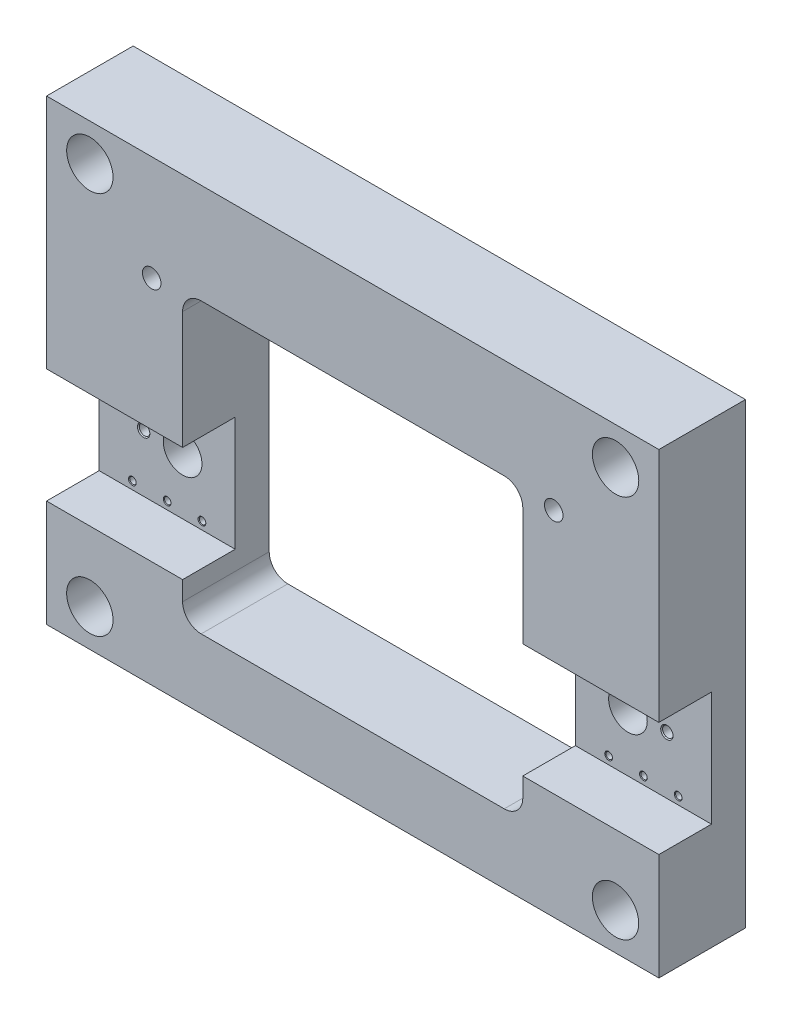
ISO-10303-21;
HEADER;
FILE_DESCRIPTION(('STEP AP214'),'2;1');
FILE_NAME('part.step','',(''),(''),'','','');
FILE_SCHEMA(('AUTOMOTIVE_DESIGN { 1 0 10303 214 1 1 1 1 }'));
ENDSEC;
DATA;
#1=APPLICATION_CONTEXT('core data for automotive mechanical design processes');
#2=APPLICATION_PROTOCOL_DEFINITION('international standard','automotive_design',2000,#1);
#3=PRODUCT_CONTEXT('',#1,'mechanical');
#4=PRODUCT('Part','Part','',(#3));
#5=PRODUCT_RELATED_PRODUCT_CATEGORY('part','',(#4));
#6=PRODUCT_DEFINITION_FORMATION('','',#4);
#7=PRODUCT_DEFINITION_CONTEXT('part definition',#1,'design');
#8=PRODUCT_DEFINITION('design','',#6,#7);
#9=PRODUCT_DEFINITION_SHAPE('','',#8);
#10=(LENGTH_UNIT() NAMED_UNIT(*) SI_UNIT(.MILLI.,.METRE.));
#11=(NAMED_UNIT(*) PLANE_ANGLE_UNIT() SI_UNIT($,.RADIAN.));
#12=(NAMED_UNIT(*) SI_UNIT($,.STERADIAN.) SOLID_ANGLE_UNIT());
#13=UNCERTAINTY_MEASURE_WITH_UNIT(LENGTH_MEASURE(1.E-05),#10,'distance_accuracy_value','');
#14=(GEOMETRIC_REPRESENTATION_CONTEXT(3) GLOBAL_UNCERTAINTY_ASSIGNED_CONTEXT((#13)) GLOBAL_UNIT_ASSIGNED_CONTEXT((#10,
#11,#12)) REPRESENTATION_CONTEXT('',''));
#15=CARTESIAN_POINT('',(0.,0.,0.));
#16=DIRECTION('',(0.,0.,1.));
#17=DIRECTION('',(1.,0.,0.));
#18=AXIS2_PLACEMENT_3D('',#15,#16,#17);
#19=CARTESIAN_POINT('',(-170.,-124.,0.));
#20=DIRECTION('',(0.,0.,1.));
#21=DIRECTION('',(1.,0.,0.));
#22=AXIS2_PLACEMENT_3D('',#19,#20,#21);
#23=PLANE('',#22);
#24=CARTESIAN_POINT('',(170.,-124.,0.));
#25=DIRECTION('',(0.,0.,1.));
#26=DIRECTION('',(1.,0.,0.));
#27=AXIS2_PLACEMENT_3D('',#24,#25,#26);
#28=CIRCLE('',#27,15.);
#29=CARTESIAN_POINT('',(185.,-124.,0.));
#30=VERTEX_POINT('',#29);
#31=EDGE_CURVE('E618',#30,#30,#28,.T.);
#32=ORIENTED_EDGE('',*,*,#31,.F.);
#33=EDGE_LOOP('',(#32));
#34=FACE_BOUND('',#33,.T.);
#35=CARTESIAN_POINT('',(-170.,-124.,0.));
#36=DIRECTION('',(0.,0.,1.));
#37=DIRECTION('',(1.,0.,0.));
#38=AXIS2_PLACEMENT_3D('',#35,#36,#37);
#39=CIRCLE('',#38,15.);
#40=CARTESIAN_POINT('',(-155.,-124.,0.));
#41=VERTEX_POINT('',#40);
#42=EDGE_CURVE('E606',#41,#41,#39,.T.);
#43=ORIENTED_EDGE('',*,*,#42,.F.);
#44=EDGE_LOOP('',(#43));
#45=FACE_BOUND('',#44,.T.);
#46=DIRECTION('',(0.,1.,0.));
#47=VECTOR('',#46,1.);
#48=CARTESIAN_POINT('',(198.,-148.,0.));
#49=LINE('',#48,#47);
#50=CARTESIAN_POINT('',(198.,-148.,0.));
#51=VERTEX_POINT('',#50);
#52=CARTESIAN_POINT('',(198.,-78.85,0.));
#53=VERTEX_POINT('',#52);
#54=EDGE_CURVE('E607',#51,#53,#49,.T.);
#55=ORIENTED_EDGE('',*,*,#54,.T.);
#56=DIRECTION('',(-1.,0.,0.));
#57=VECTOR('',#56,1.);
#58=CARTESIAN_POINT('',(280.,-78.85,0.));
#59=LINE('',#58,#57);
#60=CARTESIAN_POINT('',(110.,-78.85,0.));
#61=VERTEX_POINT('',#60);
#62=EDGE_CURVE('E678',#53,#61,#59,.T.);
#63=ORIENTED_EDGE('',*,*,#62,.T.);
#64=DIRECTION('',(0.,-1.,0.));
#65=VECTOR('',#64,1.);
#66=CARTESIAN_POINT('',(110.,71.25,0.));
#67=LINE('',#66,#65);
#68=CARTESIAN_POINT('',(110.,-91.25,0.));
#69=VERTEX_POINT('',#68);
#70=EDGE_CURVE('E445',#61,#69,#67,.T.);
#71=ORIENTED_EDGE('',*,*,#70,.T.);
#72=CARTESIAN_POINT('',(98.,-91.25,0.));
#73=DIRECTION('',(0.,0.,-1.));
#74=DIRECTION('',(1.,0.,0.));
#75=AXIS2_PLACEMENT_3D('',#72,#73,#74);
#76=CIRCLE('',#75,12.);
#77=CARTESIAN_POINT('',(98.,-103.25,0.));
#78=VERTEX_POINT('',#77);
#79=EDGE_CURVE('E449',#69,#78,#76,.T.);
#80=ORIENTED_EDGE('',*,*,#79,.T.);
#81=DIRECTION('',(-1.,0.,0.));
#82=VECTOR('',#81,1.);
#83=CARTESIAN_POINT('',(98.,-103.25,0.));
#84=LINE('',#83,#82);
#85=CARTESIAN_POINT('',(-98.,-103.25,0.));
#86=VERTEX_POINT('',#85);
#87=EDGE_CURVE('E452',#78,#86,#84,.T.);
#88=ORIENTED_EDGE('',*,*,#87,.T.);
#89=CARTESIAN_POINT('',(-98.,-91.25,0.));
#90=DIRECTION('',(0.,0.,-1.));
#91=DIRECTION('',(1.,0.,0.));
#92=AXIS2_PLACEMENT_3D('',#89,#90,#91);
#93=CIRCLE('',#92,12.);
#94=CARTESIAN_POINT('',(-110.,-91.25,0.));
#95=VERTEX_POINT('',#94);
#96=EDGE_CURVE('E455',#86,#95,#93,.T.);
#97=ORIENTED_EDGE('',*,*,#96,.T.);
#98=DIRECTION('',(0.,1.,0.));
#99=VECTOR('',#98,1.);
#100=CARTESIAN_POINT('',(-110.,-91.25,0.));
#101=LINE('',#100,#99);
#102=CARTESIAN_POINT('',(-110.,-78.85,0.));
#103=VERTEX_POINT('',#102);
#104=EDGE_CURVE('E459',#95,#103,#101,.T.);
#105=ORIENTED_EDGE('',*,*,#104,.T.);
#106=DIRECTION('',(-1.,0.,0.));
#107=VECTOR('',#106,1.);
#108=CARTESIAN_POINT('',(280.,-78.85,0.));
#109=LINE('',#108,#107);
#110=CARTESIAN_POINT('',(-198.,-78.85,0.));
#111=VERTEX_POINT('',#110);
#112=EDGE_CURVE('E31',#103,#111,#109,.T.);
#113=ORIENTED_EDGE('',*,*,#112,.T.);
#114=DIRECTION('',(0.,-1.,0.));
#115=VECTOR('',#114,1.);
#116=CARTESIAN_POINT('',(-198.,148.,0.));
#117=LINE('',#116,#115);
#118=CARTESIAN_POINT('',(-198.,-148.,0.));
#119=VERTEX_POINT('',#118);
#120=EDGE_CURVE('E592',#111,#119,#117,.T.);
#121=ORIENTED_EDGE('',*,*,#120,.T.);
#122=DIRECTION('',(1.,0.,0.));
#123=VECTOR('',#122,1.);
#124=CARTESIAN_POINT('',(-198.,-148.,0.));
#125=LINE('',#124,#123);
#126=EDGE_CURVE('E602',#119,#51,#125,.T.);
#127=ORIENTED_EDGE('',*,*,#126,.T.);
#128=EDGE_LOOP('',(#55,#63,#71,#80,#88,#97,#105,#113,#121,#127));
#129=FACE_BOUND('',#128,.T.);
#130=ADVANCED_FACE('F16',(#34,#45,#129),#23,.T.);
#131=CARTESIAN_POINT('',(-130.,80.,0.));
#132=DIRECTION('',(0.,0.,1.));
#133=DIRECTION('',(1.,0.,0.));
#134=AXIS2_PLACEMENT_3D('',#131,#132,#133);
#135=CIRCLE('',#134,6.);
#136=CARTESIAN_POINT('',(-124.,80.,0.));
#137=VERTEX_POINT('',#136);
#138=EDGE_CURVE('E412',#137,#137,#135,.T.);
#139=ORIENTED_EDGE('',*,*,#138,.F.);
#140=EDGE_LOOP('',(#139));
#141=FACE_BOUND('',#140,.T.);
#142=CARTESIAN_POINT('',(130.,80.,0.));
#143=DIRECTION('',(0.,0.,1.));
#144=DIRECTION('',(1.,0.,0.));
#145=AXIS2_PLACEMENT_3D('',#142,#143,#144);
#146=CIRCLE('',#145,6.);
#147=CARTESIAN_POINT('',(136.,80.,0.));
#148=VERTEX_POINT('',#147);
#149=EDGE_CURVE('E418',#148,#148,#146,.T.);
#150=ORIENTED_EDGE('',*,*,#149,.F.);
#151=EDGE_LOOP('',(#150));
#152=FACE_BOUND('',#151,.T.);
#153=CARTESIAN_POINT('',(170.,124.,0.));
#154=DIRECTION('',(0.,0.,1.));
#155=DIRECTION('',(1.,0.,0.));
#156=AXIS2_PLACEMENT_3D('',#153,#154,#155);
#157=CIRCLE('',#156,15.);
#158=CARTESIAN_POINT('',(185.,124.,0.));
#159=VERTEX_POINT('',#158);
#160=EDGE_CURVE('E615',#159,#159,#157,.T.);
#161=ORIENTED_EDGE('',*,*,#160,.F.);
#162=EDGE_LOOP('',(#161));
#163=FACE_BOUND('',#162,.T.);
#164=CARTESIAN_POINT('',(-170.,124.,0.));
#165=DIRECTION('',(0.,0.,1.));
#166=DIRECTION('',(1.,0.,0.));
#167=AXIS2_PLACEMENT_3D('',#164,#165,#166);
#168=CIRCLE('',#167,15.);
#169=CARTESIAN_POINT('',(-155.,124.,0.));
#170=VERTEX_POINT('',#169);
#171=EDGE_CURVE('E570',#170,#170,#168,.T.);
#172=ORIENTED_EDGE('',*,*,#171,.F.);
#173=EDGE_LOOP('',(#172));
#174=FACE_BOUND('',#173,.T.);
#175=CARTESIAN_POINT('',(-198.,148.,0.));
#176=VERTEX_POINT('',#175);
#177=CARTESIAN_POINT('',(-198.,-4.85000000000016,0.));
#178=VERTEX_POINT('',#177);
#179=EDGE_CURVE('E599',#176,#178,#117,.T.);
#180=ORIENTED_EDGE('',*,*,#179,.T.);
#181=DIRECTION('',(1.,0.,0.));
#182=VECTOR('',#181,1.);
#183=CARTESIAN_POINT('',(-230.,-4.85000000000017,0.));
#184=LINE('',#183,#182);
#185=CARTESIAN_POINT('',(-110.,-4.85000000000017,0.));
#186=VERTEX_POINT('',#185);
#187=EDGE_CURVE('E658',#178,#186,#184,.T.);
#188=ORIENTED_EDGE('',*,*,#187,.T.);
#189=CARTESIAN_POINT('',(-110.,71.25,0.));
#190=VERTEX_POINT('',#189);
#191=EDGE_CURVE('E458',#186,#190,#101,.T.);
#192=ORIENTED_EDGE('',*,*,#191,.T.);
#193=CARTESIAN_POINT('',(-98.,71.25,0.));
#194=DIRECTION('',(0.,0.,-1.));
#195=DIRECTION('',(1.,0.,0.));
#196=AXIS2_PLACEMENT_3D('',#193,#194,#195);
#197=CIRCLE('',#196,12.);
#198=CARTESIAN_POINT('',(-98.,83.25,0.));
#199=VERTEX_POINT('',#198);
#200=EDGE_CURVE('E462',#190,#199,#197,.T.);
#201=ORIENTED_EDGE('',*,*,#200,.T.);
#202=DIRECTION('',(1.,0.,0.));
#203=VECTOR('',#202,1.);
#204=CARTESIAN_POINT('',(-98.,83.25,0.));
#205=LINE('',#204,#203);
#206=CARTESIAN_POINT('',(98.,83.25,0.));
#207=VERTEX_POINT('',#206);
#208=EDGE_CURVE('E465',#199,#207,#205,.T.);
#209=ORIENTED_EDGE('',*,*,#208,.T.);
#210=CARTESIAN_POINT('',(98.,71.25,0.));
#211=DIRECTION('',(0.,0.,-1.));
#212=DIRECTION('',(1.,0.,0.));
#213=AXIS2_PLACEMENT_3D('',#210,#211,#212);
#214=CIRCLE('',#213,12.);
#215=CARTESIAN_POINT('',(110.,71.25,0.));
#216=VERTEX_POINT('',#215);
#217=EDGE_CURVE('E468',#207,#216,#214,.T.);
#218=ORIENTED_EDGE('',*,*,#217,.T.);
#219=CARTESIAN_POINT('',(110.,-4.85000000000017,0.));
#220=VERTEX_POINT('',#219);
#221=EDGE_CURVE('E446',#216,#220,#67,.T.);
#222=ORIENTED_EDGE('',*,*,#221,.T.);
#223=DIRECTION('',(1.,0.,0.));
#224=VECTOR('',#223,1.);
#225=CARTESIAN_POINT('',(-230.,-4.85000000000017,0.));
#226=LINE('',#225,#224);
#227=CARTESIAN_POINT('',(198.,-4.85000000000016,0.));
#228=VERTEX_POINT('',#227);
#229=EDGE_CURVE('E434',#220,#228,#226,.T.);
#230=ORIENTED_EDGE('',*,*,#229,.T.);
#231=CARTESIAN_POINT('',(198.,148.,0.));
#232=VERTEX_POINT('',#231);
#233=EDGE_CURVE('E610',#228,#232,#49,.T.);
#234=ORIENTED_EDGE('',*,*,#233,.T.);
#235=DIRECTION('',(-1.,0.,0.));
#236=VECTOR('',#235,1.);
#237=CARTESIAN_POINT('',(198.,148.,0.));
#238=LINE('',#237,#236);
#239=EDGE_CURVE('E603',#232,#176,#238,.T.);
#240=ORIENTED_EDGE('',*,*,#239,.T.);
#241=EDGE_LOOP('',(#180,#188,#192,#201,#209,#218,#222,#230,#234,#240));
#242=FACE_BOUND('',#241,.T.);
#243=ADVANCED_FACE('F221',(#141,#152,#163,#174,#242),#23,.T.);
#244=CARTESIAN_POINT('',(-198.,148.,-56.));
#245=DIRECTION('',(-1.,0.,0.));
#246=DIRECTION('',(0.,0.,1.));
#247=AXIS2_PLACEMENT_3D('',#244,#245,#246);
#248=PLANE('',#247);
#249=DIRECTION('',(0.,1.,0.));
#250=VECTOR('',#249,1.);
#251=CARTESIAN_POINT('',(-198.,148.,-34.));
#252=LINE('',#251,#250);
#253=CARTESIAN_POINT('',(-198.,-78.85,-34.));
#254=VERTEX_POINT('',#253);
#255=CARTESIAN_POINT('',(-198.,-4.85000000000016,-34.));
#256=VERTEX_POINT('',#255);
#257=EDGE_CURVE('E442',#254,#256,#252,.T.);
#258=ORIENTED_EDGE('',*,*,#257,.T.);
#259=DIRECTION('',(0.,0.,1.));
#260=VECTOR('',#259,1.);
#261=CARTESIAN_POINT('',(-198.,-4.85000000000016,-56.));
#262=LINE('',#261,#260);
#263=EDGE_CURVE('E439',#256,#178,#262,.T.);
#264=ORIENTED_EDGE('',*,*,#263,.T.);
#265=ORIENTED_EDGE('',*,*,#179,.F.);
#266=DIRECTION('',(0.,0.,1.));
#267=VECTOR('',#266,1.);
#268=CARTESIAN_POINT('',(-198.,148.,-56.));
#269=LINE('',#268,#267);
#270=CARTESIAN_POINT('',(-198.,148.,-56.));
#271=VERTEX_POINT('',#270);
#272=EDGE_CURVE('E579',#271,#176,#269,.T.);
#273=ORIENTED_EDGE('',*,*,#272,.F.);
#274=DIRECTION('',(0.,-1.,0.));
#275=VECTOR('',#274,1.);
#276=CARTESIAN_POINT('',(-198.,148.,-56.));
#277=LINE('',#276,#275);
#278=CARTESIAN_POINT('',(-198.,-148.,-56.));
#279=VERTEX_POINT('',#278);
#280=EDGE_CURVE('E566',#271,#279,#277,.T.);
#281=ORIENTED_EDGE('',*,*,#280,.T.);
#282=DIRECTION('',(0.,0.,1.));
#283=VECTOR('',#282,1.);
#284=CARTESIAN_POINT('',(-198.,-148.,-56.));
#285=LINE('',#284,#283);
#286=EDGE_CURVE('E585',#279,#119,#285,.T.);
#287=ORIENTED_EDGE('',*,*,#286,.T.);
#288=ORIENTED_EDGE('',*,*,#120,.F.);
#289=DIRECTION('',(0.,0.,-1.));
#290=VECTOR('',#289,1.);
#291=CARTESIAN_POINT('',(-198.,-78.85,-56.));
#292=LINE('',#291,#290);
#293=EDGE_CURVE('E676',#111,#254,#292,.T.);
#294=ORIENTED_EDGE('',*,*,#293,.T.);
#295=EDGE_LOOP('',(#258,#264,#265,#273,#281,#287,#288,#294));
#296=FACE_BOUND('',#295,.T.);
#297=ADVANCED_FACE('F227',(#296),#248,.T.);
#298=CARTESIAN_POINT('',(198.,-148.,-56.));
#299=DIRECTION('',(1.,0.,0.));
#300=DIRECTION('',(0.,0.,-1.));
#301=AXIS2_PLACEMENT_3D('',#298,#299,#300);
#302=PLANE('',#301);
#303=ORIENTED_EDGE('',*,*,#233,.F.);
#304=DIRECTION('',(0.,0.,-1.));
#305=VECTOR('',#304,1.);
#306=CARTESIAN_POINT('',(198.,-4.85000000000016,-56.));
#307=LINE('',#306,#305);
#308=CARTESIAN_POINT('',(198.,-4.85000000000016,-34.));
#309=VERTEX_POINT('',#308);
#310=EDGE_CURVE('E659',#228,#309,#307,.T.);
#311=ORIENTED_EDGE('',*,*,#310,.T.);
#312=DIRECTION('',(0.,-1.,0.));
#313=VECTOR('',#312,1.);
#314=CARTESIAN_POINT('',(198.,-148.,-34.));
#315=LINE('',#314,#313);
#316=CARTESIAN_POINT('',(198.,-78.85,-34.));
#317=VERTEX_POINT('',#316);
#318=EDGE_CURVE('E438',#309,#317,#315,.T.);
#319=ORIENTED_EDGE('',*,*,#318,.T.);
#320=DIRECTION('',(0.,0.,1.));
#321=VECTOR('',#320,1.);
#322=CARTESIAN_POINT('',(198.,-78.85,-56.));
#323=LINE('',#322,#321);
#324=EDGE_CURVE('E679',#317,#53,#323,.T.);
#325=ORIENTED_EDGE('',*,*,#324,.T.);
#326=ORIENTED_EDGE('',*,*,#54,.F.);
#327=DIRECTION('',(0.,0.,1.));
#328=VECTOR('',#327,1.);
#329=CARTESIAN_POINT('',(198.,-148.,-56.));
#330=LINE('',#329,#328);
#331=CARTESIAN_POINT('',(198.,-148.,-56.));
#332=VERTEX_POINT('',#331);
#333=EDGE_CURVE('E583',#332,#51,#330,.T.);
#334=ORIENTED_EDGE('',*,*,#333,.F.);
#335=DIRECTION('',(0.,1.,0.));
#336=VECTOR('',#335,1.);
#337=CARTESIAN_POINT('',(198.,-148.,-56.));
#338=LINE('',#337,#336);
#339=CARTESIAN_POINT('',(198.,148.,-56.));
#340=VERTEX_POINT('',#339);
#341=EDGE_CURVE('E573',#332,#340,#338,.T.);
#342=ORIENTED_EDGE('',*,*,#341,.T.);
#343=DIRECTION('',(0.,0.,1.));
#344=VECTOR('',#343,1.);
#345=CARTESIAN_POINT('',(198.,148.,-56.));
#346=LINE('',#345,#344);
#347=EDGE_CURVE('E580',#340,#232,#346,.T.);
#348=ORIENTED_EDGE('',*,*,#347,.T.);
#349=EDGE_LOOP('',(#303,#311,#319,#325,#326,#334,#342,#348));
#350=FACE_BOUND('',#349,.T.);
#351=ADVANCED_FACE('F854',(#350),#302,.T.);
#352=CARTESIAN_POINT('',(-110.,-91.25,-554.4));
#353=DIRECTION('',(1.,0.,0.));
#354=DIRECTION('',(0.,1.,0.));
#355=AXIS2_PLACEMENT_3D('',#352,#353,#354);
#356=PLANE('',#355);
#357=ORIENTED_EDGE('',*,*,#191,.F.);
#358=DIRECTION('',(0.,0.,-1.));
#359=VECTOR('',#358,1.);
#360=CARTESIAN_POINT('',(-110.,-4.85000000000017,-554.4));
#361=LINE('',#360,#359);
#362=CARTESIAN_POINT('',(-110.,-4.85000000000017,-34.));
#363=VERTEX_POINT('',#362);
#364=EDGE_CURVE('E662',#186,#363,#361,.T.);
#365=ORIENTED_EDGE('',*,*,#364,.T.);
#366=DIRECTION('',(0.,-1.,0.));
#367=VECTOR('',#366,1.);
#368=CARTESIAN_POINT('',(-110.,-91.25,-34.));
#369=LINE('',#368,#367);
#370=CARTESIAN_POINT('',(-110.,-78.85,-34.));
#371=VERTEX_POINT('',#370);
#372=EDGE_CURVE('E435',#363,#371,#369,.T.);
#373=ORIENTED_EDGE('',*,*,#372,.T.);
#374=DIRECTION('',(0.,0.,1.));
#375=VECTOR('',#374,1.);
#376=CARTESIAN_POINT('',(-110.,-78.85,-554.4));
#377=LINE('',#376,#375);
#378=EDGE_CURVE('E665',#371,#103,#377,.T.);
#379=ORIENTED_EDGE('',*,*,#378,.T.);
#380=ORIENTED_EDGE('',*,*,#104,.F.);
#381=DIRECTION('',(0.,0.,1.));
#382=VECTOR('',#381,1.);
#383=CARTESIAN_POINT('',(-110.,-91.25,-554.4));
#384=LINE('',#383,#382);
#385=CARTESIAN_POINT('',(-110.,-91.25,-56.));
#386=VERTEX_POINT('',#385);
#387=EDGE_CURVE('E479',#386,#95,#384,.T.);
#388=ORIENTED_EDGE('',*,*,#387,.F.);
#389=DIRECTION('',(0.,-1.,0.));
#390=VECTOR('',#389,1.);
#391=CARTESIAN_POINT('',(-110.,-91.25,-56.));
#392=LINE('',#391,#390);
#393=CARTESIAN_POINT('',(-110.,71.25,-56.));
#394=VERTEX_POINT('',#393);
#395=EDGE_CURVE('E499',#394,#386,#392,.T.);
#396=ORIENTED_EDGE('',*,*,#395,.F.);
#397=DIRECTION('',(0.,0.,1.));
#398=VECTOR('',#397,1.);
#399=CARTESIAN_POINT('',(-110.,71.25,-554.4));
#400=LINE('',#399,#398);
#401=EDGE_CURVE('E476',#394,#190,#400,.T.);
#402=ORIENTED_EDGE('',*,*,#401,.T.);
#403=EDGE_LOOP('',(#357,#365,#373,#379,#380,#388,#396,#402));
#404=FACE_BOUND('',#403,.T.);
#405=ADVANCED_FACE('F856',(#404),#356,.T.);
#406=CARTESIAN_POINT('',(110.,71.25,-554.4));
#407=DIRECTION('',(-1.,0.,0.));
#408=DIRECTION('',(0.,-1.,0.));
#409=AXIS2_PLACEMENT_3D('',#406,#407,#408);
#410=PLANE('',#409);
#411=DIRECTION('',(0.,1.,0.));
#412=VECTOR('',#411,1.);
#413=CARTESIAN_POINT('',(110.,71.25,-34.));
#414=LINE('',#413,#412);
#415=CARTESIAN_POINT('',(110.,-78.85,-34.));
#416=VERTEX_POINT('',#415);
#417=CARTESIAN_POINT('',(110.,-4.85000000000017,-34.));
#418=VERTEX_POINT('',#417);
#419=EDGE_CURVE('E623',#416,#418,#414,.T.);
#420=ORIENTED_EDGE('',*,*,#419,.T.);
#421=DIRECTION('',(0.,0.,1.));
#422=VECTOR('',#421,1.);
#423=CARTESIAN_POINT('',(110.,-4.85000000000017,-554.4));
#424=LINE('',#423,#422);
#425=EDGE_CURVE('E626',#418,#220,#424,.T.);
#426=ORIENTED_EDGE('',*,*,#425,.T.);
#427=ORIENTED_EDGE('',*,*,#221,.F.);
#428=DIRECTION('',(0.,0.,1.));
#429=VECTOR('',#428,1.);
#430=CARTESIAN_POINT('',(110.,71.25,-554.4));
#431=LINE('',#430,#429);
#432=CARTESIAN_POINT('',(110.,71.25,-56.));
#433=VERTEX_POINT('',#432);
#434=EDGE_CURVE('E471',#433,#216,#431,.T.);
#435=ORIENTED_EDGE('',*,*,#434,.F.);
#436=DIRECTION('',(0.,1.,0.));
#437=VECTOR('',#436,1.);
#438=CARTESIAN_POINT('',(110.,71.25,-56.));
#439=LINE('',#438,#437);
#440=CARTESIAN_POINT('',(110.,-91.25,-56.));
#441=VERTEX_POINT('',#440);
#442=EDGE_CURVE('E511',#441,#433,#439,.T.);
#443=ORIENTED_EDGE('',*,*,#442,.F.);
#444=DIRECTION('',(0.,0.,1.));
#445=VECTOR('',#444,1.);
#446=CARTESIAN_POINT('',(110.,-91.25,-554.4));
#447=LINE('',#446,#445);
#448=EDGE_CURVE('E486',#441,#69,#447,.T.);
#449=ORIENTED_EDGE('',*,*,#448,.T.);
#450=ORIENTED_EDGE('',*,*,#70,.F.);
#451=DIRECTION('',(0.,0.,-1.));
#452=VECTOR('',#451,1.);
#453=CARTESIAN_POINT('',(110.,-78.85,-554.4));
#454=LINE('',#453,#452);
#455=EDGE_CURVE('E588',#61,#416,#454,.T.);
#456=ORIENTED_EDGE('',*,*,#455,.T.);
#457=EDGE_LOOP('',(#420,#426,#427,#435,#443,#449,#450,#456));
#458=FACE_BOUND('',#457,.T.);
#459=ADVANCED_FACE('F767',(#458),#410,.T.);
#460=CARTESIAN_POINT('',(-170.,-124.,-56.));
#461=DIRECTION('',(0.,0.,1.));
#462=DIRECTION('',(1.,0.,0.));
#463=AXIS2_PLACEMENT_3D('',#460,#461,#462);
#464=PLANE('',#463);
#465=CARTESIAN_POINT('',(169.2,-41.85,-56.));
#466=DIRECTION('',(0.,0.,-1.));
#467=DIRECTION('',(0.,1.,0.));
#468=AXIS2_PLACEMENT_3D('',#465,#466,#467);
#469=CIRCLE('',#468,5.);
#470=CARTESIAN_POINT('',(169.2,-36.85,-56.));
#471=VERTEX_POINT('',#470);
#472=EDGE_CURVE('E402',#471,#471,#469,.T.);
#473=ORIENTED_EDGE('',*,*,#472,.F.);
#474=EDGE_LOOP('',(#473));
#475=FACE_BOUND('',#474,.T.);
#476=CARTESIAN_POINT('',(-169.2,-41.85,-56.));
#477=DIRECTION('',(0.,0.,-1.));
#478=DIRECTION('',(0.,1.,0.));
#479=AXIS2_PLACEMENT_3D('',#476,#477,#478);
#480=CIRCLE('',#479,5.);
#481=CARTESIAN_POINT('',(-169.2,-36.85,-56.));
#482=VERTEX_POINT('',#481);
#483=EDGE_CURVE('E406',#482,#482,#480,.T.);
#484=ORIENTED_EDGE('',*,*,#483,.F.);
#485=EDGE_LOOP('',(#484));
#486=FACE_BOUND('',#485,.T.);
#487=CARTESIAN_POINT('',(-130.,80.,-56.));
#488=DIRECTION('',(0.,0.,1.));
#489=DIRECTION('',(1.,0.,0.));
#490=AXIS2_PLACEMENT_3D('',#487,#488,#489);
#491=CIRCLE('',#490,6.);
#492=CARTESIAN_POINT('',(-124.,80.,-56.));
#493=VERTEX_POINT('',#492);
#494=EDGE_CURVE('E417',#493,#493,#491,.T.);
#495=ORIENTED_EDGE('',*,*,#494,.T.);
#496=EDGE_LOOP('',(#495));
#497=FACE_BOUND('',#496,.T.);
#498=CARTESIAN_POINT('',(130.,80.,-56.));
#499=DIRECTION('',(0.,0.,1.));
#500=DIRECTION('',(1.,0.,0.));
#501=AXIS2_PLACEMENT_3D('',#498,#499,#500);
#502=CIRCLE('',#501,6.);
#503=CARTESIAN_POINT('',(136.,80.,-56.));
#504=VERTEX_POINT('',#503);
#505=EDGE_CURVE('E421',#504,#504,#502,.T.);
#506=ORIENTED_EDGE('',*,*,#505,.T.);
#507=EDGE_LOOP('',(#506));
#508=FACE_BOUND('',#507,.T.);
#509=CARTESIAN_POINT('',(-144.,-41.85,-56.));
#510=DIRECTION('',(0.,0.,1.));
#511=DIRECTION('',(1.,0.,0.));
#512=AXIS2_PLACEMENT_3D('',#509,#510,#511);
#513=CIRCLE('',#512,12.5);
#514=CARTESIAN_POINT('',(-131.5,-41.85,-56.));
#515=VERTEX_POINT('',#514);
#516=EDGE_CURVE('E425',#515,#515,#513,.T.);
#517=ORIENTED_EDGE('',*,*,#516,.T.);
#518=EDGE_LOOP('',(#517));
#519=FACE_BOUND('',#518,.T.);
#520=CARTESIAN_POINT('',(144.,-41.85,-56.));
#521=DIRECTION('',(0.,0.,1.));
#522=DIRECTION('',(1.,0.,0.));
#523=AXIS2_PLACEMENT_3D('',#520,#521,#522);
#524=CIRCLE('',#523,12.5);
#525=CARTESIAN_POINT('',(156.5,-41.85,-56.));
#526=VERTEX_POINT('',#525);
#527=EDGE_CURVE('E431',#526,#526,#524,.T.);
#528=ORIENTED_EDGE('',*,*,#527,.T.);
#529=EDGE_LOOP('',(#528));
#530=FACE_BOUND('',#529,.T.);
#531=DIRECTION('',(1.,0.,0.));
#532=VECTOR('',#531,1.);
#533=CARTESIAN_POINT('',(98.,-103.25,-56.));
#534=LINE('',#533,#532);
#535=CARTESIAN_POINT('',(-98.,-103.25,-56.));
#536=VERTEX_POINT('',#535);
#537=CARTESIAN_POINT('',(98.,-103.25,-56.));
#538=VERTEX_POINT('',#537);
#539=EDGE_CURVE('E505',#536,#538,#534,.T.);
#540=ORIENTED_EDGE('',*,*,#539,.T.);
#541=CARTESIAN_POINT('',(98.,-91.25,-56.));
#542=DIRECTION('',(0.,0.,1.));
#543=DIRECTION('',(1.,0.,0.));
#544=AXIS2_PLACEMENT_3D('',#541,#542,#543);
#545=CIRCLE('',#544,12.);
#546=EDGE_CURVE('E508',#538,#441,#545,.T.);
#547=ORIENTED_EDGE('',*,*,#546,.T.);
#548=ORIENTED_EDGE('',*,*,#442,.T.);
#549=CARTESIAN_POINT('',(98.,71.25,-56.));
#550=DIRECTION('',(0.,0.,1.));
#551=DIRECTION('',(1.,0.,0.));
#552=AXIS2_PLACEMENT_3D('',#549,#550,#551);
#553=CIRCLE('',#552,12.);
#554=CARTESIAN_POINT('',(98.,83.25,-56.));
#555=VERTEX_POINT('',#554);
#556=EDGE_CURVE('E489',#433,#555,#553,.T.);
#557=ORIENTED_EDGE('',*,*,#556,.T.);
#558=DIRECTION('',(-1.,0.,0.));
#559=VECTOR('',#558,1.);
#560=CARTESIAN_POINT('',(-98.,83.25,-56.));
#561=LINE('',#560,#559);
#562=CARTESIAN_POINT('',(-98.,83.25,-56.));
#563=VERTEX_POINT('',#562);
#564=EDGE_CURVE('E493',#555,#563,#561,.T.);
#565=ORIENTED_EDGE('',*,*,#564,.T.);
#566=CARTESIAN_POINT('',(-98.,71.25,-56.));
#567=DIRECTION('',(0.,0.,1.));
#568=DIRECTION('',(1.,0.,0.));
#569=AXIS2_PLACEMENT_3D('',#566,#567,#568);
#570=CIRCLE('',#569,12.);
#571=EDGE_CURVE('E496',#563,#394,#570,.T.);
#572=ORIENTED_EDGE('',*,*,#571,.T.);
#573=ORIENTED_EDGE('',*,*,#395,.T.);
#574=CARTESIAN_POINT('',(-98.,-91.25,-56.));
#575=DIRECTION('',(0.,0.,1.));
#576=DIRECTION('',(1.,0.,0.));
#577=AXIS2_PLACEMENT_3D('',#574,#575,#576);
#578=CIRCLE('',#577,12.);
#579=EDGE_CURVE('E502',#386,#536,#578,.T.);
#580=ORIENTED_EDGE('',*,*,#579,.T.);
#581=EDGE_LOOP('',(#540,#547,#548,#557,#565,#572,#573,#580));
#582=FACE_BOUND('',#581,.T.);
#583=CARTESIAN_POINT('',(142.,-124.,-56.));
#584=DIRECTION('',(0.,0.,1.));
#585=DIRECTION('',(1.,0.,0.));
#586=AXIS2_PLACEMENT_3D('',#583,#584,#585);
#587=CIRCLE('',#586,6.);
#588=CARTESIAN_POINT('',(148.,-124.,-56.));
#589=VERTEX_POINT('',#588);
#590=EDGE_CURVE('E514',#589,#589,#587,.T.);
#591=ORIENTED_EDGE('',*,*,#590,.T.);
#592=EDGE_LOOP('',(#591));
#593=FACE_BOUND('',#592,.T.);
#594=CARTESIAN_POINT('',(142.,124.,-56.));
#595=DIRECTION('',(0.,0.,1.));
#596=DIRECTION('',(1.,0.,0.));
#597=AXIS2_PLACEMENT_3D('',#594,#595,#596);
#598=CIRCLE('',#597,6.);
#599=CARTESIAN_POINT('',(148.,124.,-56.));
#600=VERTEX_POINT('',#599);
#601=EDGE_CURVE('E518',#600,#600,#598,.T.);
#602=ORIENTED_EDGE('',*,*,#601,.T.);
#603=EDGE_LOOP('',(#602));
#604=FACE_BOUND('',#603,.T.);
#605=CARTESIAN_POINT('',(-142.,124.,-56.));
#606=DIRECTION('',(0.,0.,1.));
#607=DIRECTION('',(1.,0.,0.));
#608=AXIS2_PLACEMENT_3D('',#605,#606,#607);
#609=CIRCLE('',#608,6.);
#610=CARTESIAN_POINT('',(-136.,124.,-56.));
#611=VERTEX_POINT('',#610);
#612=EDGE_CURVE('E524',#611,#611,#609,.T.);
#613=ORIENTED_EDGE('',*,*,#612,.T.);
#614=EDGE_LOOP('',(#613));
#615=FACE_BOUND('',#614,.T.);
#616=CARTESIAN_POINT('',(-142.,-124.,-56.));
#617=DIRECTION('',(0.,0.,1.));
#618=DIRECTION('',(1.,0.,0.));
#619=AXIS2_PLACEMENT_3D('',#616,#617,#618);
#620=CIRCLE('',#619,6.);
#621=CARTESIAN_POINT('',(-136.,-124.,-56.));
#622=VERTEX_POINT('',#621);
#623=EDGE_CURVE('E530',#622,#622,#620,.T.);
#624=ORIENTED_EDGE('',*,*,#623,.T.);
#625=EDGE_LOOP('',(#624));
#626=FACE_BOUND('',#625,.T.);
#627=CARTESIAN_POINT('',(-170.,-124.,-56.));
#628=DIRECTION('',(0.,0.,1.));
#629=DIRECTION('',(1.,0.,0.));
#630=AXIS2_PLACEMENT_3D('',#627,#628,#629);
#631=CIRCLE('',#630,18.);
#632=CARTESIAN_POINT('',(-152.,-124.,-56.));
#633=VERTEX_POINT('',#632);
#634=EDGE_CURVE('E549',#633,#633,#631,.T.);
#635=ORIENTED_EDGE('',*,*,#634,.T.);
#636=EDGE_LOOP('',(#635));
#637=FACE_BOUND('',#636,.T.);
#638=CARTESIAN_POINT('',(170.,124.,-56.));
#639=DIRECTION('',(0.,0.,1.));
#640=DIRECTION('',(1.,0.,0.));
#641=AXIS2_PLACEMENT_3D('',#638,#639,#640);
#642=CIRCLE('',#641,18.);
#643=CARTESIAN_POINT('',(188.,124.,-56.));
#644=VERTEX_POINT('',#643);
#645=EDGE_CURVE('E563',#644,#644,#642,.T.);
#646=ORIENTED_EDGE('',*,*,#645,.T.);
#647=EDGE_LOOP('',(#646));
#648=FACE_BOUND('',#647,.T.);
#649=ORIENTED_EDGE('',*,*,#280,.F.);
#650=DIRECTION('',(-1.,0.,0.));
#651=VECTOR('',#650,1.);
#652=CARTESIAN_POINT('',(198.,148.,-56.));
#653=LINE('',#652,#651);
#654=EDGE_CURVE('E576',#340,#271,#653,.T.);
#655=ORIENTED_EDGE('',*,*,#654,.F.);
#656=ORIENTED_EDGE('',*,*,#341,.F.);
#657=DIRECTION('',(1.,0.,0.));
#658=VECTOR('',#657,1.);
#659=CARTESIAN_POINT('',(-198.,-148.,-56.));
#660=LINE('',#659,#658);
#661=EDGE_CURVE('E569',#279,#332,#660,.T.);
#662=ORIENTED_EDGE('',*,*,#661,.F.);
#663=EDGE_LOOP('',(#649,#655,#656,#662));
#664=FACE_BOUND('',#663,.T.);
#665=CARTESIAN_POINT('',(-170.,124.,-56.));
#666=DIRECTION('',(0.,0.,1.));
#667=DIRECTION('',(1.,0.,0.));
#668=AXIS2_PLACEMENT_3D('',#665,#666,#667);
#669=CIRCLE('',#668,18.);
#670=CARTESIAN_POINT('',(-152.,124.,-56.));
#671=VERTEX_POINT('',#670);
#672=EDGE_CURVE('E556',#671,#671,#669,.T.);
#673=ORIENTED_EDGE('',*,*,#672,.T.);
#674=EDGE_LOOP('',(#673));
#675=FACE_BOUND('',#674,.T.);
#676=CARTESIAN_POINT('',(170.,-124.,-56.));
#677=DIRECTION('',(0.,0.,1.));
#678=DIRECTION('',(1.,0.,0.));
#679=AXIS2_PLACEMENT_3D('',#676,#677,#678);
#680=CIRCLE('',#679,18.);
#681=CARTESIAN_POINT('',(188.,-124.,-56.));
#682=VERTEX_POINT('',#681);
#683=EDGE_CURVE('E536',#682,#682,#680,.T.);
#684=ORIENTED_EDGE('',*,*,#683,.T.);
#685=EDGE_LOOP('',(#684));
#686=FACE_BOUND('',#685,.T.);
#687=ADVANCED_FACE('F763',(#475,#486,#497,#508,#519,#530,#582,#593,#604,#615,#626,#637,#648,
#664,#675,#686),#464,.F.);
#688=CARTESIAN_POINT('',(-198.,-148.,-56.));
#689=DIRECTION('',(0.,-1.,0.));
#690=DIRECTION('',(0.,0.,-1.));
#691=AXIS2_PLACEMENT_3D('',#688,#689,#690);
#692=PLANE('',#691);
#693=ORIENTED_EDGE('',*,*,#126,.F.);
#694=ORIENTED_EDGE('',*,*,#286,.F.);
#695=ORIENTED_EDGE('',*,*,#661,.T.);
#696=ORIENTED_EDGE('',*,*,#333,.T.);
#697=EDGE_LOOP('',(#693,#694,#695,#696));
#698=FACE_BOUND('',#697,.T.);
#699=ADVANCED_FACE('F766',(#698),#692,.T.);
#700=CARTESIAN_POINT('',(170.,-124.,-56.));
#701=DIRECTION('',(0.,0.,1.));
#702=DIRECTION('',(1.,0.,0.));
#703=AXIS2_PLACEMENT_3D('',#700,#701,#702);
#704=CYLINDRICAL_SURFACE('',#703,15.);
#705=CARTESIAN_POINT('',(170.,-124.,-49.7));
#706=DIRECTION('',(0.,0.,1.));
#707=DIRECTION('',(1.,0.,0.));
#708=AXIS2_PLACEMENT_3D('',#705,#706,#707);
#709=CIRCLE('',#708,15.);
#710=CARTESIAN_POINT('',(185.,-124.,-49.7));
#711=VERTEX_POINT('',#710);
#712=EDGE_CURVE('E542',#711,#711,#709,.F.);
#713=ORIENTED_EDGE('',*,*,#712,.T.);
#714=EDGE_LOOP('',(#713));
#715=FACE_BOUND('',#714,.T.);
#716=ORIENTED_EDGE('',*,*,#31,.T.);
#717=EDGE_LOOP('',(#716));
#718=FACE_BOUND('',#717,.T.);
#719=ADVANCED_FACE('F839',(#715,#718),#704,.F.);
#720=CARTESIAN_POINT('',(170.,124.,-56.));
#721=DIRECTION('',(0.,0.,1.));
#722=DIRECTION('',(1.,0.,0.));
#723=AXIS2_PLACEMENT_3D('',#720,#721,#722);
#724=CYLINDRICAL_SURFACE('',#723,15.);
#725=CARTESIAN_POINT('',(170.,124.,-49.7));
#726=DIRECTION('',(0.,0.,1.));
#727=DIRECTION('',(1.,0.,0.));
#728=AXIS2_PLACEMENT_3D('',#725,#726,#727);
#729=CIRCLE('',#728,15.);
#730=CARTESIAN_POINT('',(185.,124.,-49.7));
#731=VERTEX_POINT('',#730);
#732=EDGE_CURVE('E562',#731,#731,#729,.F.);
#733=ORIENTED_EDGE('',*,*,#732,.T.);
#734=EDGE_LOOP('',(#733));
#735=FACE_BOUND('',#734,.T.);
#736=ORIENTED_EDGE('',*,*,#160,.T.);
#737=EDGE_LOOP('',(#736));
#738=FACE_BOUND('',#737,.T.);
#739=ADVANCED_FACE('F842',(#735,#738),#724,.F.);
#740=CARTESIAN_POINT('',(-170.,-124.,-56.));
#741=DIRECTION('',(0.,0.,1.));
#742=DIRECTION('',(1.,0.,0.));
#743=AXIS2_PLACEMENT_3D('',#740,#741,#742);
#744=CYLINDRICAL_SURFACE('',#743,15.);
#745=CARTESIAN_POINT('',(-170.,-124.,-49.7));
#746=DIRECTION('',(0.,0.,1.));
#747=DIRECTION('',(1.,0.,0.));
#748=AXIS2_PLACEMENT_3D('',#745,#746,#747);
#749=CIRCLE('',#748,15.);
#750=CARTESIAN_POINT('',(-155.,-124.,-49.7));
#751=VERTEX_POINT('',#750);
#752=EDGE_CURVE('E548',#751,#751,#749,.F.);
#753=ORIENTED_EDGE('',*,*,#752,.T.);
#754=EDGE_LOOP('',(#753));
#755=FACE_BOUND('',#754,.T.);
#756=ORIENTED_EDGE('',*,*,#42,.T.);
#757=EDGE_LOOP('',(#756));
#758=FACE_BOUND('',#757,.T.);
#759=ADVANCED_FACE('F846',(#755,#758),#744,.F.);
#760=CARTESIAN_POINT('',(198.,148.,-56.));
#761=DIRECTION('',(0.,1.,0.));
#762=DIRECTION('',(0.,0.,1.));
#763=AXIS2_PLACEMENT_3D('',#760,#761,#762);
#764=PLANE('',#763);
#765=ORIENTED_EDGE('',*,*,#239,.F.);
#766=ORIENTED_EDGE('',*,*,#347,.F.);
#767=ORIENTED_EDGE('',*,*,#654,.T.);
#768=ORIENTED_EDGE('',*,*,#272,.T.);
#769=EDGE_LOOP('',(#765,#766,#767,#768));
#770=FACE_BOUND('',#769,.T.);
#771=ADVANCED_FACE('F837',(#770),#764,.T.);
#772=CARTESIAN_POINT('',(-170.,124.,-56.));
#773=DIRECTION('',(0.,0.,1.));
#774=DIRECTION('',(1.,0.,0.));
#775=AXIS2_PLACEMENT_3D('',#772,#773,#774);
#776=CYLINDRICAL_SURFACE('',#775,15.);
#777=CARTESIAN_POINT('',(-170.,124.,-49.7));
#778=DIRECTION('',(0.,0.,1.));
#779=DIRECTION('',(1.,0.,0.));
#780=AXIS2_PLACEMENT_3D('',#777,#778,#779);
#781=CIRCLE('',#780,15.);
#782=CARTESIAN_POINT('',(-155.,124.,-49.7));
#783=VERTEX_POINT('',#782);
#784=EDGE_CURVE('E555',#783,#783,#781,.F.);
#785=ORIENTED_EDGE('',*,*,#784,.T.);
#786=EDGE_LOOP('',(#785));
#787=FACE_BOUND('',#786,.T.);
#788=ORIENTED_EDGE('',*,*,#171,.T.);
#789=EDGE_LOOP('',(#788));
#790=FACE_BOUND('',#789,.T.);
#791=ADVANCED_FACE('F830',(#787,#790),#776,.F.);
#792=CARTESIAN_POINT('',(170.,124.,-49.7));
#793=DIRECTION('',(0.,0.,1.));
#794=DIRECTION('',(1.,0.,0.));
#795=AXIS2_PLACEMENT_3D('',#792,#793,#794);
#796=PLANE('',#795);
#797=CARTESIAN_POINT('',(170.,124.,-49.7));
#798=DIRECTION('',(0.,0.,1.));
#799=DIRECTION('',(1.,0.,0.));
#800=AXIS2_PLACEMENT_3D('',#797,#798,#799);
#801=CIRCLE('',#800,18.);
#802=CARTESIAN_POINT('',(188.,124.,-49.7));
#803=VERTEX_POINT('',#802);
#804=EDGE_CURVE('E559',#803,#803,#801,.T.);
#805=ORIENTED_EDGE('',*,*,#804,.F.);
#806=EDGE_LOOP('',(#805));
#807=FACE_BOUND('',#806,.T.);
#808=ORIENTED_EDGE('',*,*,#732,.F.);
#809=EDGE_LOOP('',(#808));
#810=FACE_BOUND('',#809,.T.);
#811=ADVANCED_FACE('F827',(#807,#810),#796,.F.);
#812=CARTESIAN_POINT('',(170.,124.,-49.7));
#813=DIRECTION('',(0.,0.,-1.));
#814=DIRECTION('',(-1.,0.,0.));
#815=AXIS2_PLACEMENT_3D('',#812,#813,#814);
#816=CYLINDRICAL_SURFACE('',#815,18.);
#817=ORIENTED_EDGE('',*,*,#804,.T.);
#818=EDGE_LOOP('',(#817));
#819=FACE_BOUND('',#818,.T.);
#820=ORIENTED_EDGE('',*,*,#645,.F.);
#821=EDGE_LOOP('',(#820));
#822=FACE_BOUND('',#821,.T.);
#823=ADVANCED_FACE('F822',(#819,#822),#816,.F.);
#824=CARTESIAN_POINT('',(-170.,124.,-49.7));
#825=DIRECTION('',(0.,0.,1.));
#826=DIRECTION('',(1.,0.,0.));
#827=AXIS2_PLACEMENT_3D('',#824,#825,#826);
#828=PLANE('',#827);
#829=CARTESIAN_POINT('',(-170.,124.,-49.7));
#830=DIRECTION('',(0.,0.,1.));
#831=DIRECTION('',(1.,0.,0.));
#832=AXIS2_PLACEMENT_3D('',#829,#830,#831);
#833=CIRCLE('',#832,18.);
#834=CARTESIAN_POINT('',(-152.,124.,-49.7));
#835=VERTEX_POINT('',#834);
#836=EDGE_CURVE('E552',#835,#835,#833,.T.);
#837=ORIENTED_EDGE('',*,*,#836,.F.);
#838=EDGE_LOOP('',(#837));
#839=FACE_BOUND('',#838,.T.);
#840=ORIENTED_EDGE('',*,*,#784,.F.);
#841=EDGE_LOOP('',(#840));
#842=FACE_BOUND('',#841,.T.);
#843=ADVANCED_FACE('F819',(#839,#842),#828,.F.);
#844=CARTESIAN_POINT('',(-170.,124.,-49.7));
#845=DIRECTION('',(0.,0.,-1.));
#846=DIRECTION('',(-1.,0.,0.));
#847=AXIS2_PLACEMENT_3D('',#844,#845,#846);
#848=CYLINDRICAL_SURFACE('',#847,18.);
#849=ORIENTED_EDGE('',*,*,#836,.T.);
#850=EDGE_LOOP('',(#849));
#851=FACE_BOUND('',#850,.T.);
#852=ORIENTED_EDGE('',*,*,#672,.F.);
#853=EDGE_LOOP('',(#852));
#854=FACE_BOUND('',#853,.T.);
#855=ADVANCED_FACE('F814',(#851,#854),#848,.F.);
#856=CARTESIAN_POINT('',(-170.,-124.,-49.7));
#857=DIRECTION('',(0.,0.,1.));
#858=DIRECTION('',(1.,0.,0.));
#859=AXIS2_PLACEMENT_3D('',#856,#857,#858);
#860=PLANE('',#859);
#861=CARTESIAN_POINT('',(-170.,-124.,-49.7));
#862=DIRECTION('',(0.,0.,1.));
#863=DIRECTION('',(1.,0.,0.));
#864=AXIS2_PLACEMENT_3D('',#861,#862,#863);
#865=CIRCLE('',#864,18.);
#866=CARTESIAN_POINT('',(-152.,-124.,-49.7));
#867=VERTEX_POINT('',#866);
#868=EDGE_CURVE('E545',#867,#867,#865,.T.);
#869=ORIENTED_EDGE('',*,*,#868,.F.);
#870=EDGE_LOOP('',(#869));
#871=FACE_BOUND('',#870,.T.);
#872=ORIENTED_EDGE('',*,*,#752,.F.);
#873=EDGE_LOOP('',(#872));
#874=FACE_BOUND('',#873,.T.);
#875=ADVANCED_FACE('F811',(#871,#874),#860,.F.);
#876=CARTESIAN_POINT('',(-170.,-124.,-49.7));
#877=DIRECTION('',(0.,0.,-1.));
#878=DIRECTION('',(-1.,0.,0.));
#879=AXIS2_PLACEMENT_3D('',#876,#877,#878);
#880=CYLINDRICAL_SURFACE('',#879,18.);
#881=ORIENTED_EDGE('',*,*,#868,.T.);
#882=EDGE_LOOP('',(#881));
#883=FACE_BOUND('',#882,.T.);
#884=ORIENTED_EDGE('',*,*,#634,.F.);
#885=EDGE_LOOP('',(#884));
#886=FACE_BOUND('',#885,.T.);
#887=ADVANCED_FACE('F806',(#883,#886),#880,.F.);
#888=CARTESIAN_POINT('',(170.,-124.,-49.7));
#889=DIRECTION('',(0.,0.,1.));
#890=DIRECTION('',(1.,0.,0.));
#891=AXIS2_PLACEMENT_3D('',#888,#889,#890);
#892=PLANE('',#891);
#893=CARTESIAN_POINT('',(170.,-124.,-49.7));
#894=DIRECTION('',(0.,0.,1.));
#895=DIRECTION('',(1.,0.,0.));
#896=AXIS2_PLACEMENT_3D('',#893,#894,#895);
#897=CIRCLE('',#896,18.);
#898=CARTESIAN_POINT('',(188.,-124.,-49.7));
#899=VERTEX_POINT('',#898);
#900=EDGE_CURVE('E539',#899,#899,#897,.T.);
#901=ORIENTED_EDGE('',*,*,#900,.F.);
#902=EDGE_LOOP('',(#901));
#903=FACE_BOUND('',#902,.T.);
#904=ORIENTED_EDGE('',*,*,#712,.F.);
#905=EDGE_LOOP('',(#904));
#906=FACE_BOUND('',#905,.T.);
#907=ADVANCED_FACE('F796',(#903,#906),#892,.F.);
#908=CARTESIAN_POINT('',(170.,-124.,-49.7));
#909=DIRECTION('',(0.,0.,-1.));
#910=DIRECTION('',(-1.,0.,0.));
#911=AXIS2_PLACEMENT_3D('',#908,#909,#910);
#912=CYLINDRICAL_SURFACE('',#911,18.);
#913=ORIENTED_EDGE('',*,*,#900,.T.);
#914=EDGE_LOOP('',(#913));
#915=FACE_BOUND('',#914,.T.);
#916=ORIENTED_EDGE('',*,*,#683,.F.);
#917=EDGE_LOOP('',(#916));
#918=FACE_BOUND('',#917,.T.);
#919=ADVANCED_FACE('F793',(#915,#918),#912,.F.);
#920=CARTESIAN_POINT('',(-142.,-124.,-36.));
#921=DIRECTION('',(0.,0.,-1.));
#922=DIRECTION('',(-1.,0.,0.));
#923=AXIS2_PLACEMENT_3D('',#920,#921,#922);
#924=CONICAL_SURFACE('',#923,6.,1.02974425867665);
#925=CARTESIAN_POINT('',(-142.,-124.,-36.));
#926=DIRECTION('',(0.,0.,1.));
#927=DIRECTION('',(1.,0.,0.));
#928=AXIS2_PLACEMENT_3D('',#925,#926,#927);
#929=CIRCLE('',#928,6.);
#930=CARTESIAN_POINT('',(-136.,-124.,-36.));
#931=VERTEX_POINT('',#930);
#932=EDGE_CURVE('E533',#931,#931,#929,.T.);
#933=ORIENTED_EDGE('',*,*,#932,.F.);
#934=EDGE_LOOP('',(#933));
#935=FACE_BOUND('',#934,.T.);
#936=CARTESIAN_POINT('',(-142.,-124.,-32.3948362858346));
#937=VERTEX_POINT('',#936);
#938=VERTEX_LOOP('',#937);
#939=FACE_BOUND('',#938,.T.);
#940=ADVANCED_FACE('F795',(#935,#939),#924,.F.);
#941=CARTESIAN_POINT('',(-142.,-124.,-56.));
#942=DIRECTION('',(0.,0.,1.));
#943=DIRECTION('',(1.,0.,0.));
#944=AXIS2_PLACEMENT_3D('',#941,#942,#943);
#945=CYLINDRICAL_SURFACE('',#944,6.);
#946=ORIENTED_EDGE('',*,*,#932,.T.);
#947=EDGE_LOOP('',(#946));
#948=FACE_BOUND('',#947,.T.);
#949=ORIENTED_EDGE('',*,*,#623,.F.);
#950=EDGE_LOOP('',(#949));
#951=FACE_BOUND('',#950,.T.);
#952=ADVANCED_FACE('F803',(#948,#951),#945,.F.);
#953=CARTESIAN_POINT('',(-142.,124.,-36.));
#954=DIRECTION('',(0.,0.,-1.));
#955=DIRECTION('',(-1.,0.,0.));
#956=AXIS2_PLACEMENT_3D('',#953,#954,#955);
#957=CONICAL_SURFACE('',#956,6.,1.02974425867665);
#958=CARTESIAN_POINT('',(-142.,124.,-36.));
#959=DIRECTION('',(0.,0.,1.));
#960=DIRECTION('',(1.,0.,0.));
#961=AXIS2_PLACEMENT_3D('',#958,#959,#960);
#962=CIRCLE('',#961,6.);
#963=CARTESIAN_POINT('',(-136.,124.,-36.));
#964=VERTEX_POINT('',#963);
#965=EDGE_CURVE('E527',#964,#964,#962,.T.);
#966=ORIENTED_EDGE('',*,*,#965,.F.);
#967=EDGE_LOOP('',(#966));
#968=FACE_BOUND('',#967,.T.);
#969=CARTESIAN_POINT('',(-142.,124.,-32.3948362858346));
#970=VERTEX_POINT('',#969);
#971=VERTEX_LOOP('',#970);
#972=FACE_BOUND('',#971,.T.);
#973=ADVANCED_FACE('F954',(#968,#972),#957,.F.);
#974=CARTESIAN_POINT('',(-142.,124.,-56.));
#975=DIRECTION('',(0.,0.,1.));
#976=DIRECTION('',(1.,0.,0.));
#977=AXIS2_PLACEMENT_3D('',#974,#975,#976);
#978=CYLINDRICAL_SURFACE('',#977,6.);
#979=ORIENTED_EDGE('',*,*,#965,.T.);
#980=EDGE_LOOP('',(#979));
#981=FACE_BOUND('',#980,.T.);
#982=ORIENTED_EDGE('',*,*,#612,.F.);
#983=EDGE_LOOP('',(#982));
#984=FACE_BOUND('',#983,.T.);
#985=ADVANCED_FACE('F949',(#981,#984),#978,.F.);
#986=CARTESIAN_POINT('',(142.,124.,-36.));
#987=DIRECTION('',(0.,0.,-1.));
#988=DIRECTION('',(-1.,0.,0.));
#989=AXIS2_PLACEMENT_3D('',#986,#987,#988);
#990=CONICAL_SURFACE('',#989,6.,1.02974425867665);
#991=CARTESIAN_POINT('',(142.,124.,-36.));
#992=DIRECTION('',(0.,0.,1.));
#993=DIRECTION('',(1.,0.,0.));
#994=AXIS2_PLACEMENT_3D('',#991,#992,#993);
#995=CIRCLE('',#994,6.);
#996=CARTESIAN_POINT('',(148.,124.,-36.));
#997=VERTEX_POINT('',#996);
#998=EDGE_CURVE('E521',#997,#997,#995,.T.);
#999=ORIENTED_EDGE('',*,*,#998,.F.);
#1000=EDGE_LOOP('',(#999));
#1001=FACE_BOUND('',#1000,.T.);
#1002=CARTESIAN_POINT('',(142.,124.,-32.3948362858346));
#1003=VERTEX_POINT('',#1002);
#1004=VERTEX_LOOP('',#1003);
#1005=FACE_BOUND('',#1004,.T.);
#1006=ADVANCED_FACE('F946',(#1001,#1005),#990,.F.);
#1007=CARTESIAN_POINT('',(142.,124.,-56.));
#1008=DIRECTION('',(0.,0.,1.));
#1009=DIRECTION('',(1.,0.,0.));
#1010=AXIS2_PLACEMENT_3D('',#1007,#1008,#1009);
#1011=CYLINDRICAL_SURFACE('',#1010,6.);
#1012=ORIENTED_EDGE('',*,*,#998,.T.);
#1013=EDGE_LOOP('',(#1012));
#1014=FACE_BOUND('',#1013,.T.);
#1015=ORIENTED_EDGE('',*,*,#601,.F.);
#1016=EDGE_LOOP('',(#1015));
#1017=FACE_BOUND('',#1016,.T.);
#1018=ADVANCED_FACE('F941',(#1014,#1017),#1011,.F.);
#1019=CARTESIAN_POINT('',(142.,-124.,-36.));
#1020=DIRECTION('',(0.,0.,-1.));
#1021=DIRECTION('',(-1.,0.,0.));
#1022=AXIS2_PLACEMENT_3D('',#1019,#1020,#1021);
#1023=CONICAL_SURFACE('',#1022,6.,1.02974425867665);
#1024=CARTESIAN_POINT('',(142.,-124.,-36.));
#1025=DIRECTION('',(0.,0.,1.));
#1026=DIRECTION('',(1.,0.,0.));
#1027=AXIS2_PLACEMENT_3D('',#1024,#1025,#1026);
#1028=CIRCLE('',#1027,6.);
#1029=CARTESIAN_POINT('',(148.,-124.,-36.));
#1030=VERTEX_POINT('',#1029);
#1031=EDGE_CURVE('E515',#1030,#1030,#1028,.T.);
#1032=ORIENTED_EDGE('',*,*,#1031,.F.);
#1033=EDGE_LOOP('',(#1032));
#1034=FACE_BOUND('',#1033,.T.);
#1035=CARTESIAN_POINT('',(142.,-124.,-32.3948362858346));
#1036=VERTEX_POINT('',#1035);
#1037=VERTEX_LOOP('',#1036);
#1038=FACE_BOUND('',#1037,.T.);
#1039=ADVANCED_FACE('F938',(#1034,#1038),#1023,.F.);
#1040=CARTESIAN_POINT('',(142.,-124.,-56.));
#1041=DIRECTION('',(0.,0.,1.));
#1042=DIRECTION('',(1.,0.,0.));
#1043=AXIS2_PLACEMENT_3D('',#1040,#1041,#1042);
#1044=CYLINDRICAL_SURFACE('',#1043,6.);
#1045=ORIENTED_EDGE('',*,*,#1031,.T.);
#1046=EDGE_LOOP('',(#1045));
#1047=FACE_BOUND('',#1046,.T.);
#1048=ORIENTED_EDGE('',*,*,#590,.F.);
#1049=EDGE_LOOP('',(#1048));
#1050=FACE_BOUND('',#1049,.T.);
#1051=ADVANCED_FACE('F923',(#1047,#1050),#1044,.F.);
#1052=CARTESIAN_POINT('',(98.,-91.25,-554.4));
#1053=DIRECTION('',(0.,0.,1.));
#1054=DIRECTION('',(1.,0.,0.));
#1055=AXIS2_PLACEMENT_3D('',#1052,#1053,#1054);
#1056=CYLINDRICAL_SURFACE('',#1055,12.);
#1057=DIRECTION('',(0.,0.,1.));
#1058=VECTOR('',#1057,1.);
#1059=CARTESIAN_POINT('',(98.,-103.25,-554.4));
#1060=LINE('',#1059,#1058);
#1061=EDGE_CURVE('E483',#538,#78,#1060,.T.);
#1062=ORIENTED_EDGE('',*,*,#1061,.T.);
#1063=ORIENTED_EDGE('',*,*,#79,.F.);
#1064=ORIENTED_EDGE('',*,*,#448,.F.);
#1065=ORIENTED_EDGE('',*,*,#546,.F.);
#1066=EDGE_LOOP('',(#1062,#1063,#1064,#1065));
#1067=FACE_BOUND('',#1066,.T.);
#1068=ADVANCED_FACE('F264',(#1067),#1056,.F.);
#1069=CARTESIAN_POINT('',(98.,-103.25,-554.4));
#1070=DIRECTION('',(0.,1.,0.));
#1071=DIRECTION('',(-1.,0.,0.));
#1072=AXIS2_PLACEMENT_3D('',#1069,#1070,#1071);
#1073=PLANE('',#1072);
#1074=DIRECTION('',(0.,0.,1.));
#1075=VECTOR('',#1074,1.);
#1076=CARTESIAN_POINT('',(-98.,-103.25,-554.4));
#1077=LINE('',#1076,#1075);
#1078=EDGE_CURVE('E481',#536,#86,#1077,.T.);
#1079=ORIENTED_EDGE('',*,*,#1078,.T.);
#1080=ORIENTED_EDGE('',*,*,#87,.F.);
#1081=ORIENTED_EDGE('',*,*,#1061,.F.);
#1082=ORIENTED_EDGE('',*,*,#539,.F.);
#1083=EDGE_LOOP('',(#1079,#1080,#1081,#1082));
#1084=FACE_BOUND('',#1083,.T.);
#1085=ADVANCED_FACE('F879',(#1084),#1073,.T.);
#1086=CARTESIAN_POINT('',(-98.,-91.25,-554.4));
#1087=DIRECTION('',(0.,0.,1.));
#1088=DIRECTION('',(1.,0.,0.));
#1089=AXIS2_PLACEMENT_3D('',#1086,#1087,#1088);
#1090=CYLINDRICAL_SURFACE('',#1089,12.);
#1091=ORIENTED_EDGE('',*,*,#387,.T.);
#1092=ORIENTED_EDGE('',*,*,#96,.F.);
#1093=ORIENTED_EDGE('',*,*,#1078,.F.);
#1094=ORIENTED_EDGE('',*,*,#579,.F.);
#1095=EDGE_LOOP('',(#1091,#1092,#1093,#1094));
#1096=FACE_BOUND('',#1095,.T.);
#1097=ADVANCED_FACE('F882',(#1096),#1090,.F.);
#1098=CARTESIAN_POINT('',(-98.,71.25,-554.4));
#1099=DIRECTION('',(0.,0.,1.));
#1100=DIRECTION('',(1.,0.,0.));
#1101=AXIS2_PLACEMENT_3D('',#1098,#1099,#1100);
#1102=CYLINDRICAL_SURFACE('',#1101,12.);
#1103=DIRECTION('',(0.,0.,1.));
#1104=VECTOR('',#1103,1.);
#1105=CARTESIAN_POINT('',(-98.,83.25,-554.4));
#1106=LINE('',#1105,#1104);
#1107=EDGE_CURVE('E474',#563,#199,#1106,.T.);
#1108=ORIENTED_EDGE('',*,*,#1107,.T.);
#1109=ORIENTED_EDGE('',*,*,#200,.F.);
#1110=ORIENTED_EDGE('',*,*,#401,.F.);
#1111=ORIENTED_EDGE('',*,*,#571,.F.);
#1112=EDGE_LOOP('',(#1108,#1109,#1110,#1111));
#1113=FACE_BOUND('',#1112,.T.);
#1114=ADVANCED_FACE('F894',(#1113),#1102,.F.);
#1115=CARTESIAN_POINT('',(-98.,83.25,-554.4));
#1116=DIRECTION('',(0.,-1.,0.));
#1117=DIRECTION('',(1.,0.,0.));
#1118=AXIS2_PLACEMENT_3D('',#1115,#1116,#1117);
#1119=PLANE('',#1118);
#1120=DIRECTION('',(0.,0.,1.));
#1121=VECTOR('',#1120,1.);
#1122=CARTESIAN_POINT('',(98.,83.25,-554.4));
#1123=LINE('',#1122,#1121);
#1124=EDGE_CURVE('E472',#555,#207,#1123,.T.);
#1125=ORIENTED_EDGE('',*,*,#1124,.T.);
#1126=ORIENTED_EDGE('',*,*,#208,.F.);
#1127=ORIENTED_EDGE('',*,*,#1107,.F.);
#1128=ORIENTED_EDGE('',*,*,#564,.F.);
#1129=EDGE_LOOP('',(#1125,#1126,#1127,#1128));
#1130=FACE_BOUND('',#1129,.T.);
#1131=ADVANCED_FACE('F899',(#1130),#1119,.T.);
#1132=CARTESIAN_POINT('',(98.,71.25,-554.4));
#1133=DIRECTION('',(0.,0.,1.));
#1134=DIRECTION('',(1.,0.,0.));
#1135=AXIS2_PLACEMENT_3D('',#1132,#1133,#1134);
#1136=CYLINDRICAL_SURFACE('',#1135,12.);
#1137=ORIENTED_EDGE('',*,*,#434,.T.);
#1138=ORIENTED_EDGE('',*,*,#217,.F.);
#1139=ORIENTED_EDGE('',*,*,#1124,.F.);
#1140=ORIENTED_EDGE('',*,*,#556,.F.);
#1141=EDGE_LOOP('',(#1137,#1138,#1139,#1140));
#1142=FACE_BOUND('',#1141,.T.);
#1143=ADVANCED_FACE('F262',(#1142),#1136,.F.);
#1144=CARTESIAN_POINT('',(280.,-78.85,-336.6));
#1145=DIRECTION('',(0.,1.,0.));
#1146=DIRECTION('',(-1.,0.,0.));
#1147=AXIS2_PLACEMENT_3D('',#1144,#1145,#1146);
#1148=PLANE('',#1147);
#1149=DIRECTION('',(1.,0.,0.));
#1150=VECTOR('',#1149,1.);
#1151=CARTESIAN_POINT('',(280.,-78.85,-34.));
#1152=LINE('',#1151,#1150);
#1153=EDGE_CURVE('E40',#416,#317,#1152,.T.);
#1154=ORIENTED_EDGE('',*,*,#1153,.F.);
#1155=ORIENTED_EDGE('',*,*,#455,.F.);
#1156=ORIENTED_EDGE('',*,*,#62,.F.);
#1157=ORIENTED_EDGE('',*,*,#324,.F.);
#1158=EDGE_LOOP('',(#1154,#1155,#1156,#1157));
#1159=FACE_BOUND('',#1158,.T.);
#1160=ADVANCED_FACE('F257',(#1159),#1148,.T.);
#1161=CARTESIAN_POINT('',(-230.,-4.85000000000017,-336.6));
#1162=DIRECTION('',(0.,-1.,0.));
#1163=DIRECTION('',(1.,0.,0.));
#1164=AXIS2_PLACEMENT_3D('',#1161,#1162,#1163);
#1165=PLANE('',#1164);
#1166=ORIENTED_EDGE('',*,*,#229,.F.);
#1167=ORIENTED_EDGE('',*,*,#425,.F.);
#1168=DIRECTION('',(-1.,0.,0.));
#1169=VECTOR('',#1168,1.);
#1170=CARTESIAN_POINT('',(-230.,-4.85000000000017,-34.));
#1171=LINE('',#1170,#1169);
#1172=EDGE_CURVE('E663',#309,#418,#1171,.T.);
#1173=ORIENTED_EDGE('',*,*,#1172,.F.);
#1174=ORIENTED_EDGE('',*,*,#310,.F.);
#1175=EDGE_LOOP('',(#1166,#1167,#1173,#1174));
#1176=FACE_BOUND('',#1175,.T.);
#1177=ADVANCED_FACE('F253',(#1176),#1165,.T.);
#1178=CARTESIAN_POINT('',(-494802.,-13.8500000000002,-34.));
#1179=DIRECTION('',(0.,0.,1.));
#1180=DIRECTION('',(-1.,0.,0.));
#1181=AXIS2_PLACEMENT_3D('',#1178,#1179,#1180);
#1182=PLANE('',#1181);
#1183=CARTESIAN_POINT('',(154.,-9.85000000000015,-34.));
#1184=DIRECTION('',(0.,0.,1.));
#1185=DIRECTION('',(1.,0.,0.));
#1186=AXIS2_PLACEMENT_3D('',#1183,#1184,#1185);
#1187=CIRCLE('',#1186,2.5);
#1188=CARTESIAN_POINT('',(156.5,-9.85000000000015,-34.));
#1189=VERTEX_POINT('',#1188);
#1190=EDGE_CURVE('E342',#1189,#1189,#1187,.F.);
#1191=ORIENTED_EDGE('',*,*,#1190,.T.);
#1192=EDGE_LOOP('',(#1191));
#1193=FACE_BOUND('',#1192,.T.);
#1194=CARTESIAN_POINT('',(154.,-73.85,-34.));
#1195=DIRECTION('',(0.,0.,1.));
#1196=DIRECTION('',(1.,0.,0.));
#1197=AXIS2_PLACEMENT_3D('',#1194,#1195,#1196);
#1198=CIRCLE('',#1197,2.5);
#1199=CARTESIAN_POINT('',(156.5,-73.85,-34.));
#1200=VERTEX_POINT('',#1199);
#1201=EDGE_CURVE('E338',#1200,#1200,#1198,.F.);
#1202=ORIENTED_EDGE('',*,*,#1201,.T.);
#1203=EDGE_LOOP('',(#1202));
#1204=FACE_BOUND('',#1203,.T.);
#1205=CARTESIAN_POINT('',(131.5,-9.85000000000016,-34.));
#1206=DIRECTION('',(0.,0.,1.));
#1207=DIRECTION('',(1.,0.,0.));
#1208=AXIS2_PLACEMENT_3D('',#1205,#1206,#1207);
#1209=CIRCLE('',#1208,2.5);
#1210=CARTESIAN_POINT('',(134.,-9.85000000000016,-34.));
#1211=VERTEX_POINT('',#1210);
#1212=EDGE_CURVE('E708',#1211,#1211,#1209,.F.);
#1213=ORIENTED_EDGE('',*,*,#1212,.T.);
#1214=EDGE_LOOP('',(#1213));
#1215=FACE_BOUND('',#1214,.T.);
#1216=CARTESIAN_POINT('',(131.5,-73.85,-34.));
#1217=DIRECTION('',(0.,0.,1.));
#1218=DIRECTION('',(1.,0.,0.));
#1219=AXIS2_PLACEMENT_3D('',#1216,#1217,#1218);
#1220=CIRCLE('',#1219,2.5);
#1221=CARTESIAN_POINT('',(134.,-73.85,-34.));
#1222=VERTEX_POINT('',#1221);
#1223=EDGE_CURVE('E702',#1222,#1222,#1220,.F.);
#1224=ORIENTED_EDGE('',*,*,#1223,.T.);
#1225=EDGE_LOOP('',(#1224));
#1226=FACE_BOUND('',#1225,.T.);
#1227=CARTESIAN_POINT('',(176.5,-73.85,-34.));
#1228=DIRECTION('',(0.,0.,1.));
#1229=DIRECTION('',(1.,0.,0.));
#1230=AXIS2_PLACEMENT_3D('',#1227,#1228,#1229);
#1231=CIRCLE('',#1230,2.5);
#1232=CARTESIAN_POINT('',(179.,-73.85,-34.));
#1233=VERTEX_POINT('',#1232);
#1234=EDGE_CURVE('E696',#1233,#1233,#1231,.F.);
#1235=ORIENTED_EDGE('',*,*,#1234,.T.);
#1236=EDGE_LOOP('',(#1235));
#1237=FACE_BOUND('',#1236,.T.);
#1238=CARTESIAN_POINT('',(176.5,-9.85000000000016,-34.));
#1239=DIRECTION('',(0.,0.,1.));
#1240=DIRECTION('',(1.,0.,0.));
#1241=AXIS2_PLACEMENT_3D('',#1238,#1239,#1240);
#1242=CIRCLE('',#1241,2.5);
#1243=CARTESIAN_POINT('',(179.,-9.85000000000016,-34.));
#1244=VERTEX_POINT('',#1243);
#1245=EDGE_CURVE('E655',#1244,#1244,#1242,.F.);
#1246=ORIENTED_EDGE('',*,*,#1245,.T.);
#1247=EDGE_LOOP('',(#1246));
#1248=FACE_BOUND('',#1247,.T.);
#1249=ORIENTED_EDGE('',*,*,#1153,.T.);
#1250=ORIENTED_EDGE('',*,*,#318,.F.);
#1251=ORIENTED_EDGE('',*,*,#1172,.T.);
#1252=ORIENTED_EDGE('',*,*,#419,.F.);
#1253=EDGE_LOOP('',(#1249,#1250,#1251,#1252));
#1254=FACE_BOUND('',#1253,.T.);
#1255=CARTESIAN_POINT('',(169.2,-41.85,-34.));
#1256=DIRECTION('',(0.,0.,1.));
#1257=DIRECTION('',(1.,0.,0.));
#1258=AXIS2_PLACEMENT_3D('',#1255,#1256,#1257);
#1259=CIRCLE('',#1258,4.);
#1260=CARTESIAN_POINT('',(173.2,-41.85,-34.));
#1261=VERTEX_POINT('',#1260);
#1262=EDGE_CURVE('E640',#1261,#1261,#1259,.F.);
#1263=ORIENTED_EDGE('',*,*,#1262,.T.);
#1264=EDGE_LOOP('',(#1263));
#1265=FACE_BOUND('',#1264,.T.);
#1266=CARTESIAN_POINT('',(144.,-41.85,-34.));
#1267=DIRECTION('',(0.,0.,1.));
#1268=DIRECTION('',(1.,0.,0.));
#1269=AXIS2_PLACEMENT_3D('',#1266,#1267,#1268);
#1270=CIRCLE('',#1269,12.5);
#1271=CARTESIAN_POINT('',(156.5,-41.85,-34.));
#1272=VERTEX_POINT('',#1271);
#1273=EDGE_CURVE('E428',#1272,#1272,#1270,.T.);
#1274=ORIENTED_EDGE('',*,*,#1273,.F.);
#1275=EDGE_LOOP('',(#1274));
#1276=FACE_BOUND('',#1275,.T.);
#1277=ADVANCED_FACE('F256',(#1193,#1204,#1215,#1226,#1237,#1248,#1254,#1265,#1276),#1182,.T.);
#1278=CARTESIAN_POINT('',(-154.,-9.85000000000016,-34.));
#1279=DIRECTION('',(0.,0.,1.));
#1280=DIRECTION('',(1.,0.,0.));
#1281=AXIS2_PLACEMENT_3D('',#1278,#1279,#1280);
#1282=CIRCLE('',#1281,2.5);
#1283=CARTESIAN_POINT('',(-151.5,-9.85000000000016,-34.));
#1284=VERTEX_POINT('',#1283);
#1285=EDGE_CURVE('E24',#1284,#1284,#1282,.F.);
#1286=ORIENTED_EDGE('',*,*,#1285,.T.);
#1287=EDGE_LOOP('',(#1286));
#1288=FACE_BOUND('',#1287,.T.);
#1289=CARTESIAN_POINT('',(-154.,-73.85,-34.));
#1290=DIRECTION('',(0.,0.,1.));
#1291=DIRECTION('',(1.,0.,0.));
#1292=AXIS2_PLACEMENT_3D('',#1289,#1290,#1291);
#1293=CIRCLE('',#1292,2.5);
#1294=CARTESIAN_POINT('',(-151.5,-73.85,-34.));
#1295=VERTEX_POINT('',#1294);
#1296=EDGE_CURVE('E345',#1295,#1295,#1293,.F.);
#1297=ORIENTED_EDGE('',*,*,#1296,.T.);
#1298=EDGE_LOOP('',(#1297));
#1299=FACE_BOUND('',#1298,.T.);
#1300=CARTESIAN_POINT('',(-176.5,-9.85000000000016,-34.));
#1301=DIRECTION('',(0.,0.,1.));
#1302=DIRECTION('',(1.,0.,0.));
#1303=AXIS2_PLACEMENT_3D('',#1300,#1301,#1302);
#1304=CIRCLE('',#1303,2.5);
#1305=CARTESIAN_POINT('',(-174.,-9.85000000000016,-34.));
#1306=VERTEX_POINT('',#1305);
#1307=EDGE_CURVE('E732',#1306,#1306,#1304,.F.);
#1308=ORIENTED_EDGE('',*,*,#1307,.T.);
#1309=EDGE_LOOP('',(#1308));
#1310=FACE_BOUND('',#1309,.T.);
#1311=CARTESIAN_POINT('',(-176.5,-73.85,-34.));
#1312=DIRECTION('',(0.,0.,1.));
#1313=DIRECTION('',(1.,0.,0.));
#1314=AXIS2_PLACEMENT_3D('',#1311,#1312,#1313);
#1315=CIRCLE('',#1314,2.5);
#1316=CARTESIAN_POINT('',(-174.,-73.85,-34.));
#1317=VERTEX_POINT('',#1316);
#1318=EDGE_CURVE('E726',#1317,#1317,#1315,.F.);
#1319=ORIENTED_EDGE('',*,*,#1318,.T.);
#1320=EDGE_LOOP('',(#1319));
#1321=FACE_BOUND('',#1320,.T.);
#1322=CARTESIAN_POINT('',(-131.5,-73.85,-34.));
#1323=DIRECTION('',(0.,0.,1.));
#1324=DIRECTION('',(1.,0.,0.));
#1325=AXIS2_PLACEMENT_3D('',#1322,#1323,#1324);
#1326=CIRCLE('',#1325,2.5);
#1327=CARTESIAN_POINT('',(-129.,-73.85,-34.));
#1328=VERTEX_POINT('',#1327);
#1329=EDGE_CURVE('E720',#1328,#1328,#1326,.F.);
#1330=ORIENTED_EDGE('',*,*,#1329,.T.);
#1331=EDGE_LOOP('',(#1330));
#1332=FACE_BOUND('',#1331,.T.);
#1333=CARTESIAN_POINT('',(-131.5,-9.85000000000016,-34.));
#1334=DIRECTION('',(0.,0.,1.));
#1335=DIRECTION('',(1.,0.,0.));
#1336=AXIS2_PLACEMENT_3D('',#1333,#1334,#1335);
#1337=CIRCLE('',#1336,2.5);
#1338=CARTESIAN_POINT('',(-129.,-9.85000000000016,-34.));
#1339=VERTEX_POINT('',#1338);
#1340=EDGE_CURVE('E714',#1339,#1339,#1337,.F.);
#1341=ORIENTED_EDGE('',*,*,#1340,.T.);
#1342=EDGE_LOOP('',(#1341));
#1343=FACE_BOUND('',#1342,.T.);
#1344=DIRECTION('',(1.,0.,0.));
#1345=VECTOR('',#1344,1.);
#1346=CARTESIAN_POINT('',(280.,-78.85,-34.));
#1347=LINE('',#1346,#1345);
#1348=EDGE_CURVE('E61',#254,#371,#1347,.T.);
#1349=ORIENTED_EDGE('',*,*,#1348,.T.);
#1350=ORIENTED_EDGE('',*,*,#372,.F.);
#1351=DIRECTION('',(-1.,0.,0.));
#1352=VECTOR('',#1351,1.);
#1353=CARTESIAN_POINT('',(-230.,-4.85000000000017,-34.));
#1354=LINE('',#1353,#1352);
#1355=EDGE_CURVE('E666',#363,#256,#1354,.T.);
#1356=ORIENTED_EDGE('',*,*,#1355,.T.);
#1357=ORIENTED_EDGE('',*,*,#257,.F.);
#1358=EDGE_LOOP('',(#1349,#1350,#1356,#1357));
#1359=FACE_BOUND('',#1358,.T.);
#1360=CARTESIAN_POINT('',(-169.2,-41.85,-34.));
#1361=DIRECTION('',(0.,0.,1.));
#1362=DIRECTION('',(1.,0.,0.));
#1363=AXIS2_PLACEMENT_3D('',#1360,#1361,#1362);
#1364=CIRCLE('',#1363,4.);
#1365=CARTESIAN_POINT('',(-165.2,-41.85,-34.));
#1366=VERTEX_POINT('',#1365);
#1367=EDGE_CURVE('E652',#1366,#1366,#1364,.F.);
#1368=ORIENTED_EDGE('',*,*,#1367,.T.);
#1369=EDGE_LOOP('',(#1368));
#1370=FACE_BOUND('',#1369,.T.);
#1371=CARTESIAN_POINT('',(-144.,-41.85,-34.));
#1372=DIRECTION('',(0.,0.,1.));
#1373=DIRECTION('',(1.,0.,0.));
#1374=AXIS2_PLACEMENT_3D('',#1371,#1372,#1373);
#1375=CIRCLE('',#1374,12.5);
#1376=CARTESIAN_POINT('',(-131.5,-41.85,-34.));
#1377=VERTEX_POINT('',#1376);
#1378=EDGE_CURVE('E422',#1377,#1377,#1375,.T.);
#1379=ORIENTED_EDGE('',*,*,#1378,.F.);
#1380=EDGE_LOOP('',(#1379));
#1381=FACE_BOUND('',#1380,.T.);
#1382=ADVANCED_FACE('F356',(#1288,#1299,#1310,#1321,#1332,#1343,#1359,#1370,#1381),#1182,.T.);
#1383=ORIENTED_EDGE('',*,*,#1355,.F.);
#1384=ORIENTED_EDGE('',*,*,#364,.F.);
#1385=ORIENTED_EDGE('',*,*,#187,.F.);
#1386=ORIENTED_EDGE('',*,*,#263,.F.);
#1387=EDGE_LOOP('',(#1383,#1384,#1385,#1386));
#1388=FACE_BOUND('',#1387,.T.);
#1389=ADVANCED_FACE('F259',(#1388),#1165,.T.);
#1390=ORIENTED_EDGE('',*,*,#112,.F.);
#1391=ORIENTED_EDGE('',*,*,#378,.F.);
#1392=ORIENTED_EDGE('',*,*,#1348,.F.);
#1393=ORIENTED_EDGE('',*,*,#293,.F.);
#1394=EDGE_LOOP('',(#1390,#1391,#1392,#1393));
#1395=FACE_BOUND('',#1394,.T.);
#1396=ADVANCED_FACE('F263',(#1395),#1148,.T.);
#1397=CARTESIAN_POINT('',(144.,-41.85,-59.));
#1398=DIRECTION('',(0.,0.,1.));
#1399=DIRECTION('',(1.,0.,0.));
#1400=AXIS2_PLACEMENT_3D('',#1397,#1398,#1399);
#1401=CYLINDRICAL_SURFACE('',#1400,12.5);
#1402=ORIENTED_EDGE('',*,*,#1273,.T.);
#1403=EDGE_LOOP('',(#1402));
#1404=FACE_BOUND('',#1403,.T.);
#1405=ORIENTED_EDGE('',*,*,#527,.F.);
#1406=EDGE_LOOP('',(#1405));
#1407=FACE_BOUND('',#1406,.T.);
#1408=ADVANCED_FACE('F759',(#1404,#1407),#1401,.F.);
#1409=CARTESIAN_POINT('',(-144.,-41.85,-59.));
#1410=DIRECTION('',(0.,0.,1.));
#1411=DIRECTION('',(1.,0.,0.));
#1412=AXIS2_PLACEMENT_3D('',#1409,#1410,#1411);
#1413=CYLINDRICAL_SURFACE('',#1412,12.5);
#1414=ORIENTED_EDGE('',*,*,#1378,.T.);
#1415=EDGE_LOOP('',(#1414));
#1416=FACE_BOUND('',#1415,.T.);
#1417=ORIENTED_EDGE('',*,*,#516,.F.);
#1418=EDGE_LOOP('',(#1417));
#1419=FACE_BOUND('',#1418,.T.);
#1420=ADVANCED_FACE('F755',(#1416,#1419),#1413,.F.);
#1421=CARTESIAN_POINT('',(130.,80.,-1415.7));
#1422=DIRECTION('',(0.,0.,1.));
#1423=DIRECTION('',(1.,0.,0.));
#1424=AXIS2_PLACEMENT_3D('',#1421,#1422,#1423);
#1425=CYLINDRICAL_SURFACE('',#1424,6.);
#1426=ORIENTED_EDGE('',*,*,#149,.T.);
#1427=EDGE_LOOP('',(#1426));
#1428=FACE_BOUND('',#1427,.T.);
#1429=ORIENTED_EDGE('',*,*,#505,.F.);
#1430=EDGE_LOOP('',(#1429));
#1431=FACE_BOUND('',#1430,.T.);
#1432=ADVANCED_FACE('F758',(#1428,#1431),#1425,.F.);
#1433=CARTESIAN_POINT('',(-130.,80.,-1415.7));
#1434=DIRECTION('',(0.,0.,1.));
#1435=DIRECTION('',(1.,0.,0.));
#1436=AXIS2_PLACEMENT_3D('',#1433,#1434,#1435);
#1437=CYLINDRICAL_SURFACE('',#1436,6.);
#1438=ORIENTED_EDGE('',*,*,#138,.T.);
#1439=EDGE_LOOP('',(#1438));
#1440=FACE_BOUND('',#1439,.T.);
#1441=ORIENTED_EDGE('',*,*,#494,.F.);
#1442=EDGE_LOOP('',(#1441));
#1443=FACE_BOUND('',#1442,.T.);
#1444=ADVANCED_FACE('F1086',(#1440,#1443),#1437,.F.);
#1445=CARTESIAN_POINT('',(-169.2,-41.85,-46.));
#1446=DIRECTION('',(0.,0.,-1.));
#1447=DIRECTION('',(-1.,0.,0.));
#1448=AXIS2_PLACEMENT_3D('',#1445,#1446,#1447);
#1449=CYLINDRICAL_SURFACE('',#1448,5.);
#1450=CARTESIAN_POINT('',(-169.2,-41.85,-46.));
#1451=DIRECTION('',(0.,0.,-1.));
#1452=DIRECTION('',(0.,1.,0.));
#1453=AXIS2_PLACEMENT_3D('',#1450,#1451,#1452);
#1454=CIRCLE('',#1453,5.);
#1455=CARTESIAN_POINT('',(-169.2,-36.85,-46.));
#1456=VERTEX_POINT('',#1455);
#1457=EDGE_CURVE('E409',#1456,#1456,#1454,.T.);
#1458=ORIENTED_EDGE('',*,*,#1457,.F.);
#1459=EDGE_LOOP('',(#1458));
#1460=FACE_BOUND('',#1459,.T.);
#1461=ORIENTED_EDGE('',*,*,#483,.T.);
#1462=EDGE_LOOP('',(#1461));
#1463=FACE_BOUND('',#1462,.T.);
#1464=ADVANCED_FACE('F1095',(#1460,#1463),#1449,.F.);
#1465=CARTESIAN_POINT('',(-169.2,-41.85,-46.));
#1466=DIRECTION('',(0.,0.,-1.));
#1467=DIRECTION('',(-1.,0.,0.));
#1468=AXIS2_PLACEMENT_3D('',#1465,#1466,#1467);
#1469=PLANE('',#1468);
#1470=CARTESIAN_POINT('',(-169.2,-41.85,-46.));
#1471=DIRECTION('',(0.,0.,-1.));
#1472=DIRECTION('',(-1.,0.,0.));
#1473=AXIS2_PLACEMENT_3D('',#1470,#1471,#1472);
#1474=CIRCLE('',#1473,4.);
#1475=CARTESIAN_POINT('',(-173.2,-41.85,-46.));
#1476=VERTEX_POINT('',#1475);
#1477=EDGE_CURVE('E643',#1476,#1476,#1474,.F.);
#1478=ORIENTED_EDGE('',*,*,#1477,.T.);
#1479=EDGE_LOOP('',(#1478));
#1480=FACE_BOUND('',#1479,.T.);
#1481=ORIENTED_EDGE('',*,*,#1457,.T.);
#1482=EDGE_LOOP('',(#1481));
#1483=FACE_BOUND('',#1482,.T.);
#1484=ADVANCED_FACE('F1105',(#1480,#1483),#1469,.T.);
#1485=CARTESIAN_POINT('',(169.2,-41.85,-46.));
#1486=DIRECTION('',(0.,0.,-1.));
#1487=DIRECTION('',(-1.,0.,0.));
#1488=AXIS2_PLACEMENT_3D('',#1485,#1486,#1487);
#1489=CYLINDRICAL_SURFACE('',#1488,5.);
#1490=CARTESIAN_POINT('',(169.2,-41.85,-46.));
#1491=DIRECTION('',(0.,0.,-1.));
#1492=DIRECTION('',(0.,1.,0.));
#1493=AXIS2_PLACEMENT_3D('',#1490,#1491,#1492);
#1494=CIRCLE('',#1493,5.);
#1495=CARTESIAN_POINT('',(169.2,-36.85,-46.));
#1496=VERTEX_POINT('',#1495);
#1497=EDGE_CURVE('E403',#1496,#1496,#1494,.T.);
#1498=ORIENTED_EDGE('',*,*,#1497,.F.);
#1499=EDGE_LOOP('',(#1498));
#1500=FACE_BOUND('',#1499,.T.);
#1501=ORIENTED_EDGE('',*,*,#472,.T.);
#1502=EDGE_LOOP('',(#1501));
#1503=FACE_BOUND('',#1502,.T.);
#1504=ADVANCED_FACE('F1115',(#1500,#1503),#1489,.F.);
#1505=CARTESIAN_POINT('',(169.2,-41.85,-46.));
#1506=DIRECTION('',(0.,0.,-1.));
#1507=DIRECTION('',(-1.,0.,0.));
#1508=AXIS2_PLACEMENT_3D('',#1505,#1506,#1507);
#1509=PLANE('',#1508);
#1510=CARTESIAN_POINT('',(169.2,-41.85,-46.));
#1511=DIRECTION('',(0.,0.,-1.));
#1512=DIRECTION('',(-1.,0.,0.));
#1513=AXIS2_PLACEMENT_3D('',#1510,#1511,#1512);
#1514=CIRCLE('',#1513,4.);
#1515=CARTESIAN_POINT('',(165.2,-41.85,-46.));
#1516=VERTEX_POINT('',#1515);
#1517=EDGE_CURVE('E631',#1516,#1516,#1514,.F.);
#1518=ORIENTED_EDGE('',*,*,#1517,.T.);
#1519=EDGE_LOOP('',(#1518));
#1520=FACE_BOUND('',#1519,.T.);
#1521=ORIENTED_EDGE('',*,*,#1497,.T.);
#1522=EDGE_LOOP('',(#1521));
#1523=FACE_BOUND('',#1522,.T.);
#1524=ADVANCED_FACE('F1125',(#1520,#1523),#1509,.T.);
#1525=CARTESIAN_POINT('',(169.2,-41.85,-46.));
#1526=DIRECTION('',(0.,0.,1.));
#1527=DIRECTION('',(1.,0.,0.));
#1528=AXIS2_PLACEMENT_3D('',#1525,#1526,#1527);
#1529=CYLINDRICAL_SURFACE('',#1528,3.4);
#1530=CARTESIAN_POINT('',(169.2,-41.85,-34.6));
#1531=DIRECTION('',(0.,0.,1.));
#1532=DIRECTION('',(1.,0.,0.));
#1533=AXIS2_PLACEMENT_3D('',#1530,#1531,#1532);
#1534=CIRCLE('',#1533,3.4);
#1535=CARTESIAN_POINT('',(172.6,-41.85,-34.6));
#1536=VERTEX_POINT('',#1535);
#1537=EDGE_CURVE('E637',#1536,#1536,#1534,.T.);
#1538=ORIENTED_EDGE('',*,*,#1537,.T.);
#1539=EDGE_LOOP('',(#1538));
#1540=FACE_BOUND('',#1539,.T.);
#1541=CARTESIAN_POINT('',(169.2,-41.85,-45.4));
#1542=DIRECTION('',(0.,0.,-1.));
#1543=DIRECTION('',(-1.,0.,0.));
#1544=AXIS2_PLACEMENT_3D('',#1541,#1542,#1543);
#1545=CIRCLE('',#1544,3.4);
#1546=CARTESIAN_POINT('',(165.8,-41.85,-45.4));
#1547=VERTEX_POINT('',#1546);
#1548=EDGE_CURVE('E634',#1547,#1547,#1545,.T.);
#1549=ORIENTED_EDGE('',*,*,#1548,.T.);
#1550=EDGE_LOOP('',(#1549));
#1551=FACE_BOUND('',#1550,.T.);
#1552=ADVANCED_FACE('F238',(#1540,#1551),#1529,.F.);
#1553=CARTESIAN_POINT('',(169.2,-41.85,-46.));
#1554=DIRECTION('',(0.,0.,-1.));
#1555=DIRECTION('',(-1.,0.,0.));
#1556=AXIS2_PLACEMENT_3D('',#1553,#1554,#1555);
#1557=CONICAL_SURFACE('',#1556,4.,0.785398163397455);
#1558=ORIENTED_EDGE('',*,*,#1548,.F.);
#1559=EDGE_LOOP('',(#1558));
#1560=FACE_BOUND('',#1559,.T.);
#1561=ORIENTED_EDGE('',*,*,#1517,.F.);
#1562=EDGE_LOOP('',(#1561));
#1563=FACE_BOUND('',#1562,.T.);
#1564=ADVANCED_FACE('F234',(#1560,#1563),#1557,.F.);
#1565=CARTESIAN_POINT('',(169.2,-41.85,-34.6));
#1566=DIRECTION('',(0.,0.,1.));
#1567=DIRECTION('',(1.,0.,0.));
#1568=AXIS2_PLACEMENT_3D('',#1565,#1566,#1567);
#1569=CONICAL_SURFACE('',#1568,3.4,0.785398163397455);
#1570=ORIENTED_EDGE('',*,*,#1262,.F.);
#1571=EDGE_LOOP('',(#1570));
#1572=FACE_BOUND('',#1571,.T.);
#1573=ORIENTED_EDGE('',*,*,#1537,.F.);
#1574=EDGE_LOOP('',(#1573));
#1575=FACE_BOUND('',#1574,.T.);
#1576=ADVANCED_FACE('F237',(#1572,#1575),#1569,.F.);
#1577=CARTESIAN_POINT('',(-169.2,-41.85,-46.));
#1578=DIRECTION('',(0.,0.,1.));
#1579=DIRECTION('',(1.,0.,0.));
#1580=AXIS2_PLACEMENT_3D('',#1577,#1578,#1579);
#1581=CYLINDRICAL_SURFACE('',#1580,3.4);
#1582=CARTESIAN_POINT('',(-169.2,-41.85,-34.6));
#1583=DIRECTION('',(0.,0.,1.));
#1584=DIRECTION('',(1.,0.,0.));
#1585=AXIS2_PLACEMENT_3D('',#1582,#1583,#1584);
#1586=CIRCLE('',#1585,3.4);
#1587=CARTESIAN_POINT('',(-165.8,-41.85,-34.6));
#1588=VERTEX_POINT('',#1587);
#1589=EDGE_CURVE('E649',#1588,#1588,#1586,.T.);
#1590=ORIENTED_EDGE('',*,*,#1589,.T.);
#1591=EDGE_LOOP('',(#1590));
#1592=FACE_BOUND('',#1591,.T.);
#1593=CARTESIAN_POINT('',(-169.2,-41.85,-45.4));
#1594=DIRECTION('',(0.,0.,-1.));
#1595=DIRECTION('',(-1.,0.,0.));
#1596=AXIS2_PLACEMENT_3D('',#1593,#1594,#1595);
#1597=CIRCLE('',#1596,3.4);
#1598=CARTESIAN_POINT('',(-172.6,-41.85,-45.4));
#1599=VERTEX_POINT('',#1598);
#1600=EDGE_CURVE('E646',#1599,#1599,#1597,.T.);
#1601=ORIENTED_EDGE('',*,*,#1600,.T.);
#1602=EDGE_LOOP('',(#1601));
#1603=FACE_BOUND('',#1602,.T.);
#1604=ADVANCED_FACE('F242',(#1592,#1603),#1581,.F.);
#1605=CARTESIAN_POINT('',(-169.2,-41.85,-46.));
#1606=DIRECTION('',(0.,0.,-1.));
#1607=DIRECTION('',(-1.,0.,0.));
#1608=AXIS2_PLACEMENT_3D('',#1605,#1606,#1607);
#1609=CONICAL_SURFACE('',#1608,4.,0.785398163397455);
#1610=ORIENTED_EDGE('',*,*,#1600,.F.);
#1611=EDGE_LOOP('',(#1610));
#1612=FACE_BOUND('',#1611,.T.);
#1613=ORIENTED_EDGE('',*,*,#1477,.F.);
#1614=EDGE_LOOP('',(#1613));
#1615=FACE_BOUND('',#1614,.T.);
#1616=ADVANCED_FACE('F244',(#1612,#1615),#1609,.F.);
#1617=CARTESIAN_POINT('',(-169.2,-41.85,-34.6));
#1618=DIRECTION('',(0.,0.,1.));
#1619=DIRECTION('',(1.,0.,0.));
#1620=AXIS2_PLACEMENT_3D('',#1617,#1618,#1619);
#1621=CONICAL_SURFACE('',#1620,3.4,0.785398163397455);
#1622=ORIENTED_EDGE('',*,*,#1367,.F.);
#1623=EDGE_LOOP('',(#1622));
#1624=FACE_BOUND('',#1623,.T.);
#1625=ORIENTED_EDGE('',*,*,#1589,.F.);
#1626=EDGE_LOOP('',(#1625));
#1627=FACE_BOUND('',#1626,.T.);
#1628=ADVANCED_FACE('F247',(#1624,#1627),#1621,.F.);
#1629=CARTESIAN_POINT('',(176.5,-9.85000000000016,-48.));
#1630=DIRECTION('',(0.,0.,1.));
#1631=DIRECTION('',(1.,0.,0.));
#1632=AXIS2_PLACEMENT_3D('',#1629,#1630,#1631);
#1633=CONICAL_SURFACE('',#1632,2.1,1.02974425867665);
#1634=CARTESIAN_POINT('',(176.5,-9.85000000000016,-48.));
#1635=DIRECTION('',(0.,0.,-1.));
#1636=DIRECTION('',(-1.,0.,0.));
#1637=AXIS2_PLACEMENT_3D('',#1634,#1635,#1636);
#1638=CIRCLE('',#1637,2.1);
#1639=CARTESIAN_POINT('',(174.4,-9.85000000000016,-48.));
#1640=VERTEX_POINT('',#1639);
#1641=EDGE_CURVE('E399',#1640,#1640,#1638,.T.);
#1642=ORIENTED_EDGE('',*,*,#1641,.F.);
#1643=EDGE_LOOP('',(#1642));
#1644=FACE_BOUND('',#1643,.T.);
#1645=CARTESIAN_POINT('',(176.5,-9.85000000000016,-49.2618072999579));
#1646=VERTEX_POINT('',#1645);
#1647=VERTEX_LOOP('',#1646);
#1648=FACE_BOUND('',#1647,.T.);
#1649=ADVANCED_FACE('F251',(#1644,#1648),#1633,.F.);
#1650=CARTESIAN_POINT('',(176.5,-9.85000000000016,-34.));
#1651=DIRECTION('',(0.,0.,-1.));
#1652=DIRECTION('',(-1.,0.,0.));
#1653=AXIS2_PLACEMENT_3D('',#1650,#1651,#1652);
#1654=CYLINDRICAL_SURFACE('',#1653,2.1);
#1655=CARTESIAN_POINT('',(176.5,-9.85000000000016,-34.4));
#1656=DIRECTION('',(0.,0.,1.));
#1657=DIRECTION('',(1.,0.,0.));
#1658=AXIS2_PLACEMENT_3D('',#1655,#1656,#1657);
#1659=CIRCLE('',#1658,2.1);
#1660=CARTESIAN_POINT('',(178.6,-9.85000000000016,-34.4));
#1661=VERTEX_POINT('',#1660);
#1662=EDGE_CURVE('E693',#1661,#1661,#1659,.T.);
#1663=ORIENTED_EDGE('',*,*,#1662,.T.);
#1664=EDGE_LOOP('',(#1663));
#1665=FACE_BOUND('',#1664,.T.);
#1666=ORIENTED_EDGE('',*,*,#1641,.T.);
#1667=EDGE_LOOP('',(#1666));
#1668=FACE_BOUND('',#1667,.T.);
#1669=ADVANCED_FACE('F269',(#1665,#1668),#1654,.F.);
#1670=CARTESIAN_POINT('',(176.5,-9.85000000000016,-34.));
#1671=DIRECTION('',(0.,0.,1.));
#1672=DIRECTION('',(1.,0.,0.));
#1673=AXIS2_PLACEMENT_3D('',#1670,#1671,#1672);
#1674=CONICAL_SURFACE('',#1673,2.5,0.785398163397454);
#1675=ORIENTED_EDGE('',*,*,#1662,.F.);
#1676=EDGE_LOOP('',(#1675));
#1677=FACE_BOUND('',#1676,.T.);
#1678=ORIENTED_EDGE('',*,*,#1245,.F.);
#1679=EDGE_LOOP('',(#1678));
#1680=FACE_BOUND('',#1679,.T.);
#1681=ADVANCED_FACE('F265',(#1677,#1680),#1674,.F.);
#1682=CARTESIAN_POINT('',(176.5,-73.85,-48.));
#1683=DIRECTION('',(0.,0.,1.));
#1684=DIRECTION('',(1.,0.,0.));
#1685=AXIS2_PLACEMENT_3D('',#1682,#1683,#1684);
#1686=CONICAL_SURFACE('',#1685,2.1,1.02974425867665);
#1687=CARTESIAN_POINT('',(176.5,-73.85,-48.));
#1688=DIRECTION('',(0.,0.,-1.));
#1689=DIRECTION('',(-1.,0.,0.));
#1690=AXIS2_PLACEMENT_3D('',#1687,#1688,#1689);
#1691=CIRCLE('',#1690,2.1);
#1692=CARTESIAN_POINT('',(174.4,-73.85,-48.));
#1693=VERTEX_POINT('',#1692);
#1694=EDGE_CURVE('E396',#1693,#1693,#1691,.T.);
#1695=ORIENTED_EDGE('',*,*,#1694,.F.);
#1696=EDGE_LOOP('',(#1695));
#1697=FACE_BOUND('',#1696,.T.);
#1698=CARTESIAN_POINT('',(176.5,-73.85,-49.2618072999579));
#1699=VERTEX_POINT('',#1698);
#1700=VERTEX_LOOP('',#1699);
#1701=FACE_BOUND('',#1700,.T.);
#1702=ADVANCED_FACE('F268',(#1697,#1701),#1686,.F.);
#1703=CARTESIAN_POINT('',(176.5,-73.85,-34.));
#1704=DIRECTION('',(0.,0.,-1.));
#1705=DIRECTION('',(-1.,0.,0.));
#1706=AXIS2_PLACEMENT_3D('',#1703,#1704,#1705);
#1707=CYLINDRICAL_SURFACE('',#1706,2.1);
#1708=CARTESIAN_POINT('',(176.5,-73.85,-34.4));
#1709=DIRECTION('',(0.,0.,1.));
#1710=DIRECTION('',(1.,0.,0.));
#1711=AXIS2_PLACEMENT_3D('',#1708,#1709,#1710);
#1712=CIRCLE('',#1711,2.1);
#1713=CARTESIAN_POINT('',(178.6,-73.85,-34.4));
#1714=VERTEX_POINT('',#1713);
#1715=EDGE_CURVE('E699',#1714,#1714,#1712,.T.);
#1716=ORIENTED_EDGE('',*,*,#1715,.T.);
#1717=EDGE_LOOP('',(#1716));
#1718=FACE_BOUND('',#1717,.T.);
#1719=ORIENTED_EDGE('',*,*,#1694,.T.);
#1720=EDGE_LOOP('',(#1719));
#1721=FACE_BOUND('',#1720,.T.);
#1722=ADVANCED_FACE('F275',(#1718,#1721),#1707,.F.);
#1723=CARTESIAN_POINT('',(176.5,-73.85,-34.));
#1724=DIRECTION('',(0.,0.,1.));
#1725=DIRECTION('',(1.,0.,0.));
#1726=AXIS2_PLACEMENT_3D('',#1723,#1724,#1725);
#1727=CONICAL_SURFACE('',#1726,2.5,0.785398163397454);
#1728=ORIENTED_EDGE('',*,*,#1715,.F.);
#1729=EDGE_LOOP('',(#1728));
#1730=FACE_BOUND('',#1729,.T.);
#1731=ORIENTED_EDGE('',*,*,#1234,.F.);
#1732=EDGE_LOOP('',(#1731));
#1733=FACE_BOUND('',#1732,.T.);
#1734=ADVANCED_FACE('F271',(#1730,#1733),#1727,.F.);
#1735=CARTESIAN_POINT('',(131.5,-73.85,-48.));
#1736=DIRECTION('',(0.,0.,1.));
#1737=DIRECTION('',(1.,0.,0.));
#1738=AXIS2_PLACEMENT_3D('',#1735,#1736,#1737);
#1739=CONICAL_SURFACE('',#1738,2.1,1.02974425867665);
#1740=CARTESIAN_POINT('',(131.5,-73.85,-48.));
#1741=DIRECTION('',(0.,0.,-1.));
#1742=DIRECTION('',(-1.,0.,0.));
#1743=AXIS2_PLACEMENT_3D('',#1740,#1741,#1742);
#1744=CIRCLE('',#1743,2.1);
#1745=CARTESIAN_POINT('',(129.4,-73.85,-48.));
#1746=VERTEX_POINT('',#1745);
#1747=EDGE_CURVE('E393',#1746,#1746,#1744,.T.);
#1748=ORIENTED_EDGE('',*,*,#1747,.F.);
#1749=EDGE_LOOP('',(#1748));
#1750=FACE_BOUND('',#1749,.T.);
#1751=CARTESIAN_POINT('',(131.5,-73.85,-49.2618072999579));
#1752=VERTEX_POINT('',#1751);
#1753=VERTEX_LOOP('',#1752);
#1754=FACE_BOUND('',#1753,.T.);
#1755=ADVANCED_FACE('F274',(#1750,#1754),#1739,.F.);
#1756=CARTESIAN_POINT('',(131.5,-73.85,-34.));
#1757=DIRECTION('',(0.,0.,-1.));
#1758=DIRECTION('',(-1.,0.,0.));
#1759=AXIS2_PLACEMENT_3D('',#1756,#1757,#1758);
#1760=CYLINDRICAL_SURFACE('',#1759,2.1);
#1761=CARTESIAN_POINT('',(131.5,-73.85,-34.4));
#1762=DIRECTION('',(0.,0.,1.));
#1763=DIRECTION('',(1.,0.,0.));
#1764=AXIS2_PLACEMENT_3D('',#1761,#1762,#1763);
#1765=CIRCLE('',#1764,2.1);
#1766=CARTESIAN_POINT('',(133.6,-73.85,-34.4));
#1767=VERTEX_POINT('',#1766);
#1768=EDGE_CURVE('E705',#1767,#1767,#1765,.T.);
#1769=ORIENTED_EDGE('',*,*,#1768,.T.);
#1770=EDGE_LOOP('',(#1769));
#1771=FACE_BOUND('',#1770,.T.);
#1772=ORIENTED_EDGE('',*,*,#1747,.T.);
#1773=EDGE_LOOP('',(#1772));
#1774=FACE_BOUND('',#1773,.T.);
#1775=ADVANCED_FACE('F281',(#1771,#1774),#1760,.F.);
#1776=CARTESIAN_POINT('',(131.5,-73.85,-34.));
#1777=DIRECTION('',(0.,0.,1.));
#1778=DIRECTION('',(1.,0.,0.));
#1779=AXIS2_PLACEMENT_3D('',#1776,#1777,#1778);
#1780=CONICAL_SURFACE('',#1779,2.5,0.785398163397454);
#1781=ORIENTED_EDGE('',*,*,#1768,.F.);
#1782=EDGE_LOOP('',(#1781));
#1783=FACE_BOUND('',#1782,.T.);
#1784=ORIENTED_EDGE('',*,*,#1223,.F.);
#1785=EDGE_LOOP('',(#1784));
#1786=FACE_BOUND('',#1785,.T.);
#1787=ADVANCED_FACE('F277',(#1783,#1786),#1780,.F.);
#1788=CARTESIAN_POINT('',(131.5,-9.85000000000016,-48.));
#1789=DIRECTION('',(0.,0.,1.));
#1790=DIRECTION('',(1.,0.,0.));
#1791=AXIS2_PLACEMENT_3D('',#1788,#1789,#1790);
#1792=CONICAL_SURFACE('',#1791,2.1,1.02974425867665);
#1793=CARTESIAN_POINT('',(131.5,-9.85000000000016,-48.));
#1794=DIRECTION('',(0.,0.,-1.));
#1795=DIRECTION('',(-1.,0.,0.));
#1796=AXIS2_PLACEMENT_3D('',#1793,#1794,#1795);
#1797=CIRCLE('',#1796,2.1);
#1798=CARTESIAN_POINT('',(129.4,-9.85000000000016,-48.));
#1799=VERTEX_POINT('',#1798);
#1800=EDGE_CURVE('E390',#1799,#1799,#1797,.T.);
#1801=ORIENTED_EDGE('',*,*,#1800,.F.);
#1802=EDGE_LOOP('',(#1801));
#1803=FACE_BOUND('',#1802,.T.);
#1804=CARTESIAN_POINT('',(131.5,-9.85000000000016,-49.2618072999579));
#1805=VERTEX_POINT('',#1804);
#1806=VERTEX_LOOP('',#1805);
#1807=FACE_BOUND('',#1806,.T.);
#1808=ADVANCED_FACE('F280',(#1803,#1807),#1792,.F.);
#1809=CARTESIAN_POINT('',(131.5,-9.85000000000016,-34.));
#1810=DIRECTION('',(0.,0.,-1.));
#1811=DIRECTION('',(-1.,0.,0.));
#1812=AXIS2_PLACEMENT_3D('',#1809,#1810,#1811);
#1813=CYLINDRICAL_SURFACE('',#1812,2.1);
#1814=CARTESIAN_POINT('',(131.5,-9.85000000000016,-34.4));
#1815=DIRECTION('',(0.,0.,1.));
#1816=DIRECTION('',(1.,0.,0.));
#1817=AXIS2_PLACEMENT_3D('',#1814,#1815,#1816);
#1818=CIRCLE('',#1817,2.1);
#1819=CARTESIAN_POINT('',(133.6,-9.85000000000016,-34.4));
#1820=VERTEX_POINT('',#1819);
#1821=EDGE_CURVE('E711',#1820,#1820,#1818,.T.);
#1822=ORIENTED_EDGE('',*,*,#1821,.T.);
#1823=EDGE_LOOP('',(#1822));
#1824=FACE_BOUND('',#1823,.T.);
#1825=ORIENTED_EDGE('',*,*,#1800,.T.);
#1826=EDGE_LOOP('',(#1825));
#1827=FACE_BOUND('',#1826,.T.);
#1828=ADVANCED_FACE('F287',(#1824,#1827),#1813,.F.);
#1829=CARTESIAN_POINT('',(131.5,-9.85000000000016,-34.));
#1830=DIRECTION('',(0.,0.,1.));
#1831=DIRECTION('',(1.,0.,0.));
#1832=AXIS2_PLACEMENT_3D('',#1829,#1830,#1831);
#1833=CONICAL_SURFACE('',#1832,2.5,0.785398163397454);
#1834=ORIENTED_EDGE('',*,*,#1821,.F.);
#1835=EDGE_LOOP('',(#1834));
#1836=FACE_BOUND('',#1835,.T.);
#1837=ORIENTED_EDGE('',*,*,#1212,.F.);
#1838=EDGE_LOOP('',(#1837));
#1839=FACE_BOUND('',#1838,.T.);
#1840=ADVANCED_FACE('F283',(#1836,#1839),#1833,.F.);
#1841=CARTESIAN_POINT('',(-131.5,-9.85000000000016,-48.));
#1842=DIRECTION('',(0.,0.,1.));
#1843=DIRECTION('',(1.,0.,0.));
#1844=AXIS2_PLACEMENT_3D('',#1841,#1842,#1843);
#1845=CONICAL_SURFACE('',#1844,2.1,1.02974425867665);
#1846=CARTESIAN_POINT('',(-131.5,-9.85000000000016,-48.));
#1847=DIRECTION('',(0.,0.,-1.));
#1848=DIRECTION('',(-1.,0.,0.));
#1849=AXIS2_PLACEMENT_3D('',#1846,#1847,#1848);
#1850=CIRCLE('',#1849,2.1);
#1851=CARTESIAN_POINT('',(-133.6,-9.85000000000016,-48.));
#1852=VERTEX_POINT('',#1851);
#1853=EDGE_CURVE('E387',#1852,#1852,#1850,.T.);
#1854=ORIENTED_EDGE('',*,*,#1853,.F.);
#1855=EDGE_LOOP('',(#1854));
#1856=FACE_BOUND('',#1855,.T.);
#1857=CARTESIAN_POINT('',(-131.5,-9.85000000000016,-49.2618072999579));
#1858=VERTEX_POINT('',#1857);
#1859=VERTEX_LOOP('',#1858);
#1860=FACE_BOUND('',#1859,.T.);
#1861=ADVANCED_FACE('F286',(#1856,#1860),#1845,.F.);
#1862=CARTESIAN_POINT('',(-131.5,-9.85000000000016,-34.));
#1863=DIRECTION('',(0.,0.,-1.));
#1864=DIRECTION('',(-1.,0.,0.));
#1865=AXIS2_PLACEMENT_3D('',#1862,#1863,#1864);
#1866=CYLINDRICAL_SURFACE('',#1865,2.1);
#1867=CARTESIAN_POINT('',(-131.5,-9.85000000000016,-34.4));
#1868=DIRECTION('',(0.,0.,1.));
#1869=DIRECTION('',(1.,0.,0.));
#1870=AXIS2_PLACEMENT_3D('',#1867,#1868,#1869);
#1871=CIRCLE('',#1870,2.1);
#1872=CARTESIAN_POINT('',(-129.4,-9.85000000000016,-34.4));
#1873=VERTEX_POINT('',#1872);
#1874=EDGE_CURVE('E717',#1873,#1873,#1871,.T.);
#1875=ORIENTED_EDGE('',*,*,#1874,.T.);
#1876=EDGE_LOOP('',(#1875));
#1877=FACE_BOUND('',#1876,.T.);
#1878=ORIENTED_EDGE('',*,*,#1853,.T.);
#1879=EDGE_LOOP('',(#1878));
#1880=FACE_BOUND('',#1879,.T.);
#1881=ADVANCED_FACE('F293',(#1877,#1880),#1866,.F.);
#1882=CARTESIAN_POINT('',(-131.5,-9.85000000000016,-34.));
#1883=DIRECTION('',(0.,0.,1.));
#1884=DIRECTION('',(1.,0.,0.));
#1885=AXIS2_PLACEMENT_3D('',#1882,#1883,#1884);
#1886=CONICAL_SURFACE('',#1885,2.5,0.785398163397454);
#1887=ORIENTED_EDGE('',*,*,#1874,.F.);
#1888=EDGE_LOOP('',(#1887));
#1889=FACE_BOUND('',#1888,.T.);
#1890=ORIENTED_EDGE('',*,*,#1340,.F.);
#1891=EDGE_LOOP('',(#1890));
#1892=FACE_BOUND('',#1891,.T.);
#1893=ADVANCED_FACE('F289',(#1889,#1892),#1886,.F.);
#1894=CARTESIAN_POINT('',(-131.5,-73.85,-48.));
#1895=DIRECTION('',(0.,0.,1.));
#1896=DIRECTION('',(1.,0.,0.));
#1897=AXIS2_PLACEMENT_3D('',#1894,#1895,#1896);
#1898=CONICAL_SURFACE('',#1897,2.1,1.02974425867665);
#1899=CARTESIAN_POINT('',(-131.5,-73.85,-48.));
#1900=DIRECTION('',(0.,0.,-1.));
#1901=DIRECTION('',(-1.,0.,0.));
#1902=AXIS2_PLACEMENT_3D('',#1899,#1900,#1901);
#1903=CIRCLE('',#1902,2.1);
#1904=CARTESIAN_POINT('',(-133.6,-73.85,-48.));
#1905=VERTEX_POINT('',#1904);
#1906=EDGE_CURVE('E384',#1905,#1905,#1903,.T.);
#1907=ORIENTED_EDGE('',*,*,#1906,.F.);
#1908=EDGE_LOOP('',(#1907));
#1909=FACE_BOUND('',#1908,.T.);
#1910=CARTESIAN_POINT('',(-131.5,-73.85,-49.2618072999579));
#1911=VERTEX_POINT('',#1910);
#1912=VERTEX_LOOP('',#1911);
#1913=FACE_BOUND('',#1912,.T.);
#1914=ADVANCED_FACE('F292',(#1909,#1913),#1898,.F.);
#1915=CARTESIAN_POINT('',(-131.5,-73.85,-34.));
#1916=DIRECTION('',(0.,0.,-1.));
#1917=DIRECTION('',(-1.,0.,0.));
#1918=AXIS2_PLACEMENT_3D('',#1915,#1916,#1917);
#1919=CYLINDRICAL_SURFACE('',#1918,2.1);
#1920=CARTESIAN_POINT('',(-131.5,-73.85,-34.4));
#1921=DIRECTION('',(0.,0.,1.));
#1922=DIRECTION('',(1.,0.,0.));
#1923=AXIS2_PLACEMENT_3D('',#1920,#1921,#1922);
#1924=CIRCLE('',#1923,2.1);
#1925=CARTESIAN_POINT('',(-129.4,-73.85,-34.4));
#1926=VERTEX_POINT('',#1925);
#1927=EDGE_CURVE('E723',#1926,#1926,#1924,.T.);
#1928=ORIENTED_EDGE('',*,*,#1927,.T.);
#1929=EDGE_LOOP('',(#1928));
#1930=FACE_BOUND('',#1929,.T.);
#1931=ORIENTED_EDGE('',*,*,#1906,.T.);
#1932=EDGE_LOOP('',(#1931));
#1933=FACE_BOUND('',#1932,.T.);
#1934=ADVANCED_FACE('F299',(#1930,#1933),#1919,.F.);
#1935=CARTESIAN_POINT('',(-131.5,-73.85,-34.));
#1936=DIRECTION('',(0.,0.,1.));
#1937=DIRECTION('',(1.,0.,0.));
#1938=AXIS2_PLACEMENT_3D('',#1935,#1936,#1937);
#1939=CONICAL_SURFACE('',#1938,2.5,0.785398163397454);
#1940=ORIENTED_EDGE('',*,*,#1927,.F.);
#1941=EDGE_LOOP('',(#1940));
#1942=FACE_BOUND('',#1941,.T.);
#1943=ORIENTED_EDGE('',*,*,#1329,.F.);
#1944=EDGE_LOOP('',(#1943));
#1945=FACE_BOUND('',#1944,.T.);
#1946=ADVANCED_FACE('F295',(#1942,#1945),#1939,.F.);
#1947=CARTESIAN_POINT('',(-176.5,-73.85,-48.));
#1948=DIRECTION('',(0.,0.,1.));
#1949=DIRECTION('',(1.,0.,0.));
#1950=AXIS2_PLACEMENT_3D('',#1947,#1948,#1949);
#1951=CONICAL_SURFACE('',#1950,2.1,1.02974425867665);
#1952=CARTESIAN_POINT('',(-176.5,-73.85,-48.));
#1953=DIRECTION('',(0.,0.,-1.));
#1954=DIRECTION('',(-1.,0.,0.));
#1955=AXIS2_PLACEMENT_3D('',#1952,#1953,#1954);
#1956=CIRCLE('',#1955,2.1);
#1957=CARTESIAN_POINT('',(-178.6,-73.85,-48.));
#1958=VERTEX_POINT('',#1957);
#1959=EDGE_CURVE('E381',#1958,#1958,#1956,.T.);
#1960=ORIENTED_EDGE('',*,*,#1959,.F.);
#1961=EDGE_LOOP('',(#1960));
#1962=FACE_BOUND('',#1961,.T.);
#1963=CARTESIAN_POINT('',(-176.5,-73.85,-49.2618072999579));
#1964=VERTEX_POINT('',#1963);
#1965=VERTEX_LOOP('',#1964);
#1966=FACE_BOUND('',#1965,.T.);
#1967=ADVANCED_FACE('F298',(#1962,#1966),#1951,.F.);
#1968=CARTESIAN_POINT('',(-176.5,-73.85,-34.));
#1969=DIRECTION('',(0.,0.,-1.));
#1970=DIRECTION('',(-1.,0.,0.));
#1971=AXIS2_PLACEMENT_3D('',#1968,#1969,#1970);
#1972=CYLINDRICAL_SURFACE('',#1971,2.1);
#1973=CARTESIAN_POINT('',(-176.5,-73.85,-34.4));
#1974=DIRECTION('',(0.,0.,1.));
#1975=DIRECTION('',(1.,0.,0.));
#1976=AXIS2_PLACEMENT_3D('',#1973,#1974,#1975);
#1977=CIRCLE('',#1976,2.1);
#1978=CARTESIAN_POINT('',(-174.4,-73.85,-34.4));
#1979=VERTEX_POINT('',#1978);
#1980=EDGE_CURVE('E729',#1979,#1979,#1977,.T.);
#1981=ORIENTED_EDGE('',*,*,#1980,.T.);
#1982=EDGE_LOOP('',(#1981));
#1983=FACE_BOUND('',#1982,.T.);
#1984=ORIENTED_EDGE('',*,*,#1959,.T.);
#1985=EDGE_LOOP('',(#1984));
#1986=FACE_BOUND('',#1985,.T.);
#1987=ADVANCED_FACE('F305',(#1983,#1986),#1972,.F.);
#1988=CARTESIAN_POINT('',(-176.5,-73.85,-34.));
#1989=DIRECTION('',(0.,0.,1.));
#1990=DIRECTION('',(1.,0.,0.));
#1991=AXIS2_PLACEMENT_3D('',#1988,#1989,#1990);
#1992=CONICAL_SURFACE('',#1991,2.5,0.785398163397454);
#1993=ORIENTED_EDGE('',*,*,#1980,.F.);
#1994=EDGE_LOOP('',(#1993));
#1995=FACE_BOUND('',#1994,.T.);
#1996=ORIENTED_EDGE('',*,*,#1318,.F.);
#1997=EDGE_LOOP('',(#1996));
#1998=FACE_BOUND('',#1997,.T.);
#1999=ADVANCED_FACE('F301',(#1995,#1998),#1992,.F.);
#2000=CARTESIAN_POINT('',(-176.5,-9.85000000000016,-48.));
#2001=DIRECTION('',(0.,0.,1.));
#2002=DIRECTION('',(1.,0.,0.));
#2003=AXIS2_PLACEMENT_3D('',#2000,#2001,#2002);
#2004=CONICAL_SURFACE('',#2003,2.1,1.02974425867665);
#2005=CARTESIAN_POINT('',(-176.5,-9.85000000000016,-48.));
#2006=DIRECTION('',(0.,0.,-1.));
#2007=DIRECTION('',(-1.,0.,0.));
#2008=AXIS2_PLACEMENT_3D('',#2005,#2006,#2007);
#2009=CIRCLE('',#2008,2.1);
#2010=CARTESIAN_POINT('',(-178.6,-9.85000000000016,-48.));
#2011=VERTEX_POINT('',#2010);
#2012=EDGE_CURVE('E378',#2011,#2011,#2009,.T.);
#2013=ORIENTED_EDGE('',*,*,#2012,.F.);
#2014=EDGE_LOOP('',(#2013));
#2015=FACE_BOUND('',#2014,.T.);
#2016=CARTESIAN_POINT('',(-176.5,-9.85000000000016,-49.2618072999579));
#2017=VERTEX_POINT('',#2016);
#2018=VERTEX_LOOP('',#2017);
#2019=FACE_BOUND('',#2018,.T.);
#2020=ADVANCED_FACE('F304',(#2015,#2019),#2004,.F.);
#2021=CARTESIAN_POINT('',(-176.5,-9.85000000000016,-34.));
#2022=DIRECTION('',(0.,0.,-1.));
#2023=DIRECTION('',(-1.,0.,0.));
#2024=AXIS2_PLACEMENT_3D('',#2021,#2022,#2023);
#2025=CYLINDRICAL_SURFACE('',#2024,2.1);
#2026=CARTESIAN_POINT('',(-176.5,-9.85000000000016,-34.4));
#2027=DIRECTION('',(0.,0.,1.));
#2028=DIRECTION('',(1.,0.,0.));
#2029=AXIS2_PLACEMENT_3D('',#2026,#2027,#2028);
#2030=CIRCLE('',#2029,2.1);
#2031=CARTESIAN_POINT('',(-174.4,-9.85000000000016,-34.4));
#2032=VERTEX_POINT('',#2031);
#2033=EDGE_CURVE('E735',#2032,#2032,#2030,.T.);
#2034=ORIENTED_EDGE('',*,*,#2033,.T.);
#2035=EDGE_LOOP('',(#2034));
#2036=FACE_BOUND('',#2035,.T.);
#2037=ORIENTED_EDGE('',*,*,#2012,.T.);
#2038=EDGE_LOOP('',(#2037));
#2039=FACE_BOUND('',#2038,.T.);
#2040=ADVANCED_FACE('F311',(#2036,#2039),#2025,.F.);
#2041=CARTESIAN_POINT('',(-176.5,-9.85000000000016,-34.));
#2042=DIRECTION('',(0.,0.,1.));
#2043=DIRECTION('',(1.,0.,0.));
#2044=AXIS2_PLACEMENT_3D('',#2041,#2042,#2043);
#2045=CONICAL_SURFACE('',#2044,2.5,0.785398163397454);
#2046=ORIENTED_EDGE('',*,*,#2033,.F.);
#2047=EDGE_LOOP('',(#2046));
#2048=FACE_BOUND('',#2047,.T.);
#2049=ORIENTED_EDGE('',*,*,#1307,.F.);
#2050=EDGE_LOOP('',(#2049));
#2051=FACE_BOUND('',#2050,.T.);
#2052=ADVANCED_FACE('F307',(#2048,#2051),#2045,.F.);
#2053=CARTESIAN_POINT('',(-154.,-73.85,-45.));
#2054=DIRECTION('',(0.,0.,1.));
#2055=DIRECTION('',(1.,0.,0.));
#2056=AXIS2_PLACEMENT_3D('',#2053,#2054,#2055);
#2057=CONICAL_SURFACE('',#2056,2.1,1.02974425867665);
#2058=CARTESIAN_POINT('',(-154.,-73.85,-45.));
#2059=DIRECTION('',(0.,0.,-1.));
#2060=DIRECTION('',(-1.,0.,0.));
#2061=AXIS2_PLACEMENT_3D('',#2058,#2059,#2060);
#2062=CIRCLE('',#2061,2.1);
#2063=CARTESIAN_POINT('',(-156.1,-73.85,-45.));
#2064=VERTEX_POINT('',#2063);
#2065=EDGE_CURVE('E375',#2064,#2064,#2062,.T.);
#2066=ORIENTED_EDGE('',*,*,#2065,.F.);
#2067=EDGE_LOOP('',(#2066));
#2068=FACE_BOUND('',#2067,.T.);
#2069=CARTESIAN_POINT('',(-154.,-73.85,-46.2618072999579));
#2070=VERTEX_POINT('',#2069);
#2071=VERTEX_LOOP('',#2070);
#2072=FACE_BOUND('',#2071,.T.);
#2073=ADVANCED_FACE('F310',(#2068,#2072),#2057,.F.);
#2074=CARTESIAN_POINT('',(-154.,-73.85,-34.));
#2075=DIRECTION('',(0.,0.,-1.));
#2076=DIRECTION('',(-1.,0.,0.));
#2077=AXIS2_PLACEMENT_3D('',#2074,#2075,#2076);
#2078=CYLINDRICAL_SURFACE('',#2077,2.1);
#2079=CARTESIAN_POINT('',(-154.,-73.85,-34.4));
#2080=DIRECTION('',(0.,0.,1.));
#2081=DIRECTION('',(1.,0.,0.));
#2082=AXIS2_PLACEMENT_3D('',#2079,#2080,#2081);
#2083=CIRCLE('',#2082,2.1);
#2084=CARTESIAN_POINT('',(-151.9,-73.85,-34.4));
#2085=VERTEX_POINT('',#2084);
#2086=EDGE_CURVE('E340',#2085,#2085,#2083,.T.);
#2087=ORIENTED_EDGE('',*,*,#2086,.T.);
#2088=EDGE_LOOP('',(#2087));
#2089=FACE_BOUND('',#2088,.T.);
#2090=ORIENTED_EDGE('',*,*,#2065,.T.);
#2091=EDGE_LOOP('',(#2090));
#2092=FACE_BOUND('',#2091,.T.);
#2093=ADVANCED_FACE('F317',(#2089,#2092),#2078,.F.);
#2094=CARTESIAN_POINT('',(-154.,-73.85,-34.));
#2095=DIRECTION('',(0.,0.,1.));
#2096=DIRECTION('',(1.,0.,0.));
#2097=AXIS2_PLACEMENT_3D('',#2094,#2095,#2096);
#2098=CONICAL_SURFACE('',#2097,2.5,0.785398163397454);
#2099=ORIENTED_EDGE('',*,*,#2086,.F.);
#2100=EDGE_LOOP('',(#2099));
#2101=FACE_BOUND('',#2100,.T.);
#2102=ORIENTED_EDGE('',*,*,#1296,.F.);
#2103=EDGE_LOOP('',(#2102));
#2104=FACE_BOUND('',#2103,.T.);
#2105=ADVANCED_FACE('F313',(#2101,#2104),#2098,.F.);
#2106=CARTESIAN_POINT('',(154.,-73.85,-45.));
#2107=DIRECTION('',(0.,0.,1.));
#2108=DIRECTION('',(1.,0.,0.));
#2109=AXIS2_PLACEMENT_3D('',#2106,#2107,#2108);
#2110=CONICAL_SURFACE('',#2109,2.1,1.02974425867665);
#2111=CARTESIAN_POINT('',(154.,-73.85,-45.));
#2112=DIRECTION('',(0.,0.,-1.));
#2113=DIRECTION('',(-1.,0.,0.));
#2114=AXIS2_PLACEMENT_3D('',#2111,#2112,#2113);
#2115=CIRCLE('',#2114,2.1);
#2116=CARTESIAN_POINT('',(151.9,-73.85,-45.));
#2117=VERTEX_POINT('',#2116);
#2118=EDGE_CURVE('E370',#2117,#2117,#2115,.T.);
#2119=ORIENTED_EDGE('',*,*,#2118,.F.);
#2120=EDGE_LOOP('',(#2119));
#2121=FACE_BOUND('',#2120,.T.);
#2122=CARTESIAN_POINT('',(154.,-73.85,-46.2618072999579));
#2123=VERTEX_POINT('',#2122);
#2124=VERTEX_LOOP('',#2123);
#2125=FACE_BOUND('',#2124,.T.);
#2126=ADVANCED_FACE('F316',(#2121,#2125),#2110,.F.);
#2127=CARTESIAN_POINT('',(154.,-73.85,-34.));
#2128=DIRECTION('',(0.,0.,-1.));
#2129=DIRECTION('',(-1.,0.,0.));
#2130=AXIS2_PLACEMENT_3D('',#2127,#2128,#2129);
#2131=CYLINDRICAL_SURFACE('',#2130,2.1);
#2132=CARTESIAN_POINT('',(154.,-73.85,-34.4));
#2133=DIRECTION('',(0.,0.,1.));
#2134=DIRECTION('',(1.,0.,0.));
#2135=AXIS2_PLACEMENT_3D('',#2132,#2133,#2134);
#2136=CIRCLE('',#2135,2.1);
#2137=CARTESIAN_POINT('',(156.1,-73.85,-34.4));
#2138=VERTEX_POINT('',#2137);
#2139=EDGE_CURVE('E335',#2138,#2138,#2136,.T.);
#2140=ORIENTED_EDGE('',*,*,#2139,.T.);
#2141=EDGE_LOOP('',(#2140));
#2142=FACE_BOUND('',#2141,.T.);
#2143=ORIENTED_EDGE('',*,*,#2118,.T.);
#2144=EDGE_LOOP('',(#2143));
#2145=FACE_BOUND('',#2144,.T.);
#2146=ADVANCED_FACE('F322',(#2142,#2145),#2131,.F.);
#2147=CARTESIAN_POINT('',(154.,-73.85,-34.));
#2148=DIRECTION('',(0.,0.,1.));
#2149=DIRECTION('',(1.,0.,0.));
#2150=AXIS2_PLACEMENT_3D('',#2147,#2148,#2149);
#2151=CONICAL_SURFACE('',#2150,2.5,0.785398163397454);
#2152=ORIENTED_EDGE('',*,*,#2139,.F.);
#2153=EDGE_LOOP('',(#2152));
#2154=FACE_BOUND('',#2153,.T.);
#2155=ORIENTED_EDGE('',*,*,#1201,.F.);
#2156=EDGE_LOOP('',(#2155));
#2157=FACE_BOUND('',#2156,.T.);
#2158=ADVANCED_FACE('F319',(#2154,#2157),#2151,.F.);
#2159=CARTESIAN_POINT('',(154.,-9.85000000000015,-45.));
#2160=DIRECTION('',(0.,0.,1.));
#2161=DIRECTION('',(1.,0.,0.));
#2162=AXIS2_PLACEMENT_3D('',#2159,#2160,#2161);
#2163=CONICAL_SURFACE('',#2162,2.1,1.02974425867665);
#2164=CARTESIAN_POINT('',(154.,-9.85000000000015,-45.));
#2165=DIRECTION('',(0.,0.,-1.));
#2166=DIRECTION('',(-1.,0.,0.));
#2167=AXIS2_PLACEMENT_3D('',#2164,#2165,#2166);
#2168=CIRCLE('',#2167,2.1);
#2169=CARTESIAN_POINT('',(151.9,-9.85000000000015,-45.));
#2170=VERTEX_POINT('',#2169);
#2171=EDGE_CURVE('E367',#2170,#2170,#2168,.T.);
#2172=ORIENTED_EDGE('',*,*,#2171,.F.);
#2173=EDGE_LOOP('',(#2172));
#2174=FACE_BOUND('',#2173,.T.);
#2175=CARTESIAN_POINT('',(154.,-9.85000000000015,-46.2618072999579));
#2176=VERTEX_POINT('',#2175);
#2177=VERTEX_LOOP('',#2176);
#2178=FACE_BOUND('',#2177,.T.);
#2179=ADVANCED_FACE('F321',(#2174,#2178),#2163,.F.);
#2180=CARTESIAN_POINT('',(154.,-9.85000000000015,-34.));
#2181=DIRECTION('',(0.,0.,-1.));
#2182=DIRECTION('',(-1.,0.,0.));
#2183=AXIS2_PLACEMENT_3D('',#2180,#2181,#2182);
#2184=CYLINDRICAL_SURFACE('',#2183,2.1);
#2185=CARTESIAN_POINT('',(154.,-9.85000000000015,-34.4));
#2186=DIRECTION('',(0.,0.,1.));
#2187=DIRECTION('',(1.,0.,0.));
#2188=AXIS2_PLACEMENT_3D('',#2185,#2186,#2187);
#2189=CIRCLE('',#2188,2.1);
#2190=CARTESIAN_POINT('',(156.1,-9.85000000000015,-34.4));
#2191=VERTEX_POINT('',#2190);
#2192=EDGE_CURVE('E351',#2191,#2191,#2189,.T.);
#2193=ORIENTED_EDGE('',*,*,#2192,.T.);
#2194=EDGE_LOOP('',(#2193));
#2195=FACE_BOUND('',#2194,.T.);
#2196=ORIENTED_EDGE('',*,*,#2171,.T.);
#2197=EDGE_LOOP('',(#2196));
#2198=FACE_BOUND('',#2197,.T.);
#2199=ADVANCED_FACE('F217',(#2195,#2198),#2184,.F.);
#2200=CARTESIAN_POINT('',(154.,-9.85000000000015,-34.));
#2201=DIRECTION('',(0.,0.,1.));
#2202=DIRECTION('',(1.,0.,0.));
#2203=AXIS2_PLACEMENT_3D('',#2200,#2201,#2202);
#2204=CONICAL_SURFACE('',#2203,2.5,0.785398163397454);
#2205=ORIENTED_EDGE('',*,*,#2192,.F.);
#2206=EDGE_LOOP('',(#2205));
#2207=FACE_BOUND('',#2206,.T.);
#2208=ORIENTED_EDGE('',*,*,#1190,.F.);
#2209=EDGE_LOOP('',(#2208));
#2210=FACE_BOUND('',#2209,.T.);
#2211=ADVANCED_FACE('F207',(#2207,#2210),#2204,.F.);
#2212=CARTESIAN_POINT('',(-154.,-9.85000000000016,-45.));
#2213=DIRECTION('',(0.,0.,1.));
#2214=DIRECTION('',(1.,0.,0.));
#2215=AXIS2_PLACEMENT_3D('',#2212,#2213,#2214);
#2216=CONICAL_SURFACE('',#2215,2.1,1.02974425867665);
#2217=CARTESIAN_POINT('',(-154.,-9.85000000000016,-45.));
#2218=DIRECTION('',(0.,0.,-1.));
#2219=DIRECTION('',(-1.,0.,0.));
#2220=AXIS2_PLACEMENT_3D('',#2217,#2218,#2219);
#2221=CIRCLE('',#2220,2.1);
#2222=CARTESIAN_POINT('',(-156.1,-9.85000000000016,-45.));
#2223=VERTEX_POINT('',#2222);
#2224=EDGE_CURVE('E366',#2223,#2223,#2221,.T.);
#2225=ORIENTED_EDGE('',*,*,#2224,.F.);
#2226=EDGE_LOOP('',(#2225));
#2227=FACE_BOUND('',#2226,.T.);
#2228=CARTESIAN_POINT('',(-154.,-9.85000000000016,-46.2618072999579));
#2229=VERTEX_POINT('',#2228);
#2230=VERTEX_LOOP('',#2229);
#2231=FACE_BOUND('',#2230,.T.);
#2232=ADVANCED_FACE('F204',(#2227,#2231),#2216,.F.);
#2233=CARTESIAN_POINT('',(-154.,-9.85000000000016,-34.));
#2234=DIRECTION('',(0.,0.,-1.));
#2235=DIRECTION('',(-1.,0.,0.));
#2236=AXIS2_PLACEMENT_3D('',#2233,#2234,#2235);
#2237=CYLINDRICAL_SURFACE('',#2236,2.1);
#2238=CARTESIAN_POINT('',(-154.,-9.85000000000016,-34.4));
#2239=DIRECTION('',(0.,0.,1.));
#2240=DIRECTION('',(1.,0.,0.));
#2241=AXIS2_PLACEMENT_3D('',#2238,#2239,#2240);
#2242=CIRCLE('',#2241,2.1);
#2243=CARTESIAN_POINT('',(-151.9,-9.85000000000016,-34.4));
#2244=VERTEX_POINT('',#2243);
#2245=EDGE_CURVE('E11',#2244,#2244,#2242,.T.);
#2246=ORIENTED_EDGE('',*,*,#2245,.T.);
#2247=EDGE_LOOP('',(#2246));
#2248=FACE_BOUND('',#2247,.T.);
#2249=ORIENTED_EDGE('',*,*,#2224,.T.);
#2250=EDGE_LOOP('',(#2249));
#2251=FACE_BOUND('',#2250,.T.);
#2252=ADVANCED_FACE('F206',(#2248,#2251),#2237,.F.);
#2253=CARTESIAN_POINT('',(-154.,-9.85000000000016,-34.));
#2254=DIRECTION('',(0.,0.,1.));
#2255=DIRECTION('',(1.,0.,0.));
#2256=AXIS2_PLACEMENT_3D('',#2253,#2254,#2255);
#2257=CONICAL_SURFACE('',#2256,2.5,0.785398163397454);
#2258=ORIENTED_EDGE('',*,*,#2245,.F.);
#2259=EDGE_LOOP('',(#2258));
#2260=FACE_BOUND('',#2259,.T.);
#2261=ORIENTED_EDGE('',*,*,#1285,.F.);
#2262=EDGE_LOOP('',(#2261));
#2263=FACE_BOUND('',#2262,.T.);
#2264=ADVANCED_FACE('F18',(#2260,#2263),#2257,.F.);
#2265=CLOSED_SHELL('',(#130,#243,#297,#351,#405,#459,#687,#699,#719,#739,#759,#771,#791,#811,
#823,#843,#855,#875,#887,#907,#919,#940,#952,#973,#985,#1006,#1018,#1039,#1051,#1068,#1085,
#1097,#1114,#1131,#1143,#1160,#1177,#1277,#1382,#1389,#1396,#1408,#1420,#1432,#1444,#1464,#1484,
#1504,#1524,#1552,#1564,#1576,#1604,#1616,#1628,#1649,#1669,#1681,#1702,#1722,#1734,#1755,#1775,
#1787,#1808,#1828,#1840,#1861,#1881,#1893,#1914,#1934,#1946,#1967,#1987,#1999,#2020,#2040,#2052,
#2073,#2093,#2105,#2126,#2146,#2158,#2179,#2199,#2211,#2232,#2252,#2264));
#2266=MANIFOLD_SOLID_BREP('B1',#2265);
#2267=ADVANCED_BREP_SHAPE_REPRESENTATION('',(#18,#2266),#14);
#2268=SHAPE_DEFINITION_REPRESENTATION(#9,#2267);
ENDSEC;
END-ISO-10303-21;
